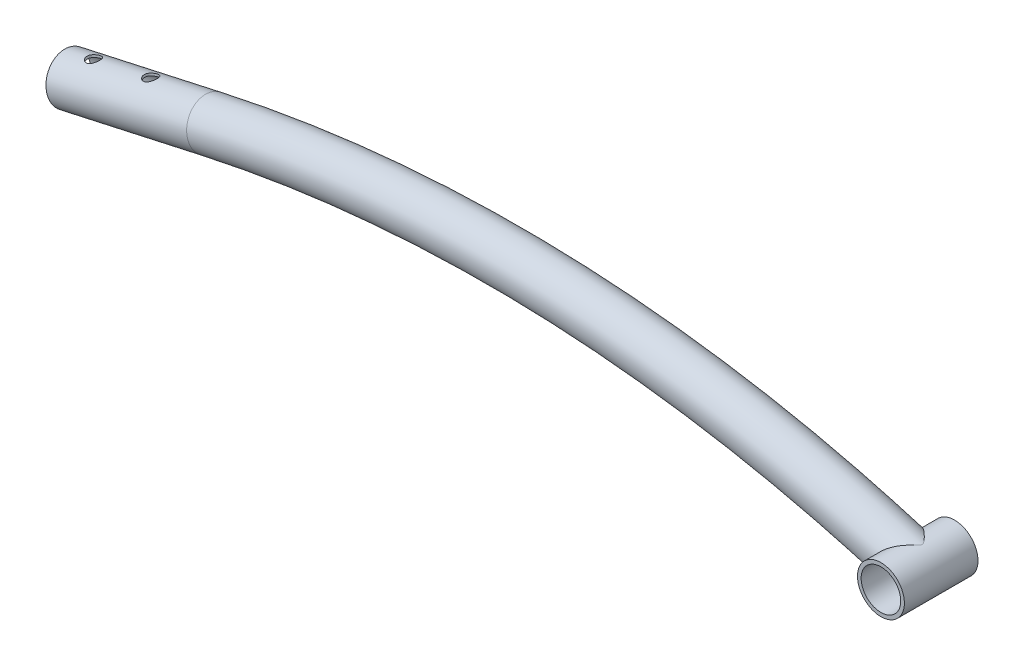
ISO-10303-21;
HEADER;
FILE_DESCRIPTION(('STEP AP214'),'2;1');
FILE_NAME('part.step','',(''),(''),'','','');
FILE_SCHEMA(('AUTOMOTIVE_DESIGN { 1 0 10303 214 1 1 1 1 }'));
ENDSEC;
DATA;
#1=APPLICATION_CONTEXT('core data for automotive mechanical design processes');
#2=APPLICATION_PROTOCOL_DEFINITION('international standard','automotive_design',2000,#1);
#3=PRODUCT_CONTEXT('',#1,'mechanical');
#4=PRODUCT('Part','Part','',(#3));
#5=PRODUCT_RELATED_PRODUCT_CATEGORY('part','',(#4));
#6=PRODUCT_DEFINITION_FORMATION('','',#4);
#7=PRODUCT_DEFINITION_CONTEXT('part definition',#1,'design');
#8=PRODUCT_DEFINITION('design','',#6,#7);
#9=PRODUCT_DEFINITION_SHAPE('','',#8);
#10=(LENGTH_UNIT() NAMED_UNIT(*) SI_UNIT(.MILLI.,.METRE.));
#11=(NAMED_UNIT(*) PLANE_ANGLE_UNIT() SI_UNIT($,.RADIAN.));
#12=(NAMED_UNIT(*) SI_UNIT($,.STERADIAN.) SOLID_ANGLE_UNIT());
#13=UNCERTAINTY_MEASURE_WITH_UNIT(LENGTH_MEASURE(1.E-05),#10,'distance_accuracy_value','');
#14=(GEOMETRIC_REPRESENTATION_CONTEXT(3) GLOBAL_UNCERTAINTY_ASSIGNED_CONTEXT((#13)) GLOBAL_UNIT_ASSIGNED_CONTEXT((#10,
#11,#12)) REPRESENTATION_CONTEXT('',''));
#15=CARTESIAN_POINT('',(0.,0.,0.));
#16=DIRECTION('',(0.,0.,1.));
#17=DIRECTION('',(1.,0.,0.));
#18=AXIS2_PLACEMENT_3D('',#15,#16,#17);
#19=CARTESIAN_POINT('',(419.518991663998,-663.791446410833,0.));
#20=DIRECTION('',(0.,0.,-1.));
#21=DIRECTION('',(-1.,0.,0.));
#22=AXIS2_PLACEMENT_3D('',#19,#20,#21);
#23=TOROIDAL_SURFACE('',#22,930.,15.9);
#24=CARTESIAN_POINT('',(218.540371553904,244.232558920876,0.));
#25=DIRECTION('',(-0.976369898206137,-0.216106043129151,0.));
#26=DIRECTION('',(0.216106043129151,-0.976369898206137,0.));
#27=AXIS2_PLACEMENT_3D('',#24,#25,#26);
#28=CIRCLE('',#27,15.9);
#29=CARTESIAN_POINT('',(221.976457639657,228.708277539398,0.));
#30=VERTEX_POINT('',#29);
#31=EDGE_CURVE('E26',#30,#30,#28,.T.);
#32=ORIENTED_EDGE('',*,*,#31,.F.);
#33=EDGE_LOOP('',(#32));
#34=FACE_BOUND('',#33,.T.);
#35=CARTESIAN_POINT('',(688.555758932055,212.416610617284,-8.52932562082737));
#36=CARTESIAN_POINT('',(688.227871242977,212.812124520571,-8.97274578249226));
#37=CARTESIAN_POINT('',(687.914068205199,213.229399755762,-9.40737734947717));
#38=CARTESIAN_POINT('',(687.320144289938,214.108144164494,-10.2550141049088));
#39=CARTESIAN_POINT('',(687.04003786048,214.569632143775,-10.6680099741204));
#40=CARTESIAN_POINT('',(686.520568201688,215.536174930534,-11.465938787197));
#41=CARTESIAN_POINT('',(686.281117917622,216.041133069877,-11.8509306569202));
#42=CARTESIAN_POINT('',(685.957896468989,216.830884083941,-12.4023359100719));
#43=CARTESIAN_POINT('',(685.856174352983,217.099431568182,-12.5817388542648));
#44=CARTESIAN_POINT('',(685.665683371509,217.647272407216,-12.930943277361));
#45=CARTESIAN_POINT('',(685.576916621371,217.926567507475,-13.1007431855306));
#46=CARTESIAN_POINT('',(685.402461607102,218.533936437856,-13.4517404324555));
#47=CARTESIAN_POINT('',(685.318808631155,218.863503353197,-13.6313793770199));
#48=CARTESIAN_POINT('',(685.171475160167,219.53504222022,-13.9747728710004));
#49=CARTESIAN_POINT('',(685.107787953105,219.877009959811,-14.1385327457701));
#50=CARTESIAN_POINT('',(685.002177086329,220.572086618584,-14.448107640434));
#51=CARTESIAN_POINT('',(684.960242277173,220.925189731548,-14.5939318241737));
#52=CARTESIAN_POINT('',(684.89985215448,221.641040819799,-14.8655812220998));
#53=CARTESIAN_POINT('',(684.881397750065,222.003789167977,-14.9914056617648));
#54=CARTESIAN_POINT('',(684.869525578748,222.740363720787,-15.2220302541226));
#55=CARTESIAN_POINT('',(684.876360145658,223.114264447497,-15.3266074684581));
#56=CARTESIAN_POINT('',(684.916977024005,223.866728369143,-15.5110388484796));
#57=CARTESIAN_POINT('',(684.950759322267,224.2452915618,-15.5908930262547));
#58=CARTESIAN_POINT('',(685.046082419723,225.003308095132,-15.7240353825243));
#59=CARTESIAN_POINT('',(685.107600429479,225.382760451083,-15.777345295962));
#60=CARTESIAN_POINT('',(685.258589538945,226.138967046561,-15.8562067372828));
#61=CARTESIAN_POINT('',(685.348056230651,226.515721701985,-15.8817626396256));
#62=CARTESIAN_POINT('',(685.540192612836,227.211166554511,-15.902959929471));
#63=CARTESIAN_POINT('',(685.639360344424,227.530723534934,-15.9022284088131));
#64=CARTESIAN_POINT('',(685.857268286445,228.162307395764,-15.879731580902));
#65=CARTESIAN_POINT('',(685.976006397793,228.474335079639,-15.8579685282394));
#66=CARTESIAN_POINT('',(686.231898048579,229.088542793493,-15.7938646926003));
#67=CARTESIAN_POINT('',(686.369051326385,229.390722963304,-15.7515242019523));
#68=CARTESIAN_POINT('',(686.660336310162,229.983240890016,-15.6470803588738));
#69=CARTESIAN_POINT('',(686.814468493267,230.273578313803,-15.5849764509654));
#70=CARTESIAN_POINT('',(687.132493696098,230.830981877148,-15.444572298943));
#71=CARTESIAN_POINT('',(687.295867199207,231.098505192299,-15.3669040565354));
#72=CARTESIAN_POINT('',(687.635364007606,231.619853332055,-15.1953400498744));
#73=CARTESIAN_POINT('',(687.811486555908,231.873678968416,-15.1014452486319));
#74=CARTESIAN_POINT('',(688.174979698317,232.366915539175,-14.8986615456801));
#75=CARTESIAN_POINT('',(688.362352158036,232.606324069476,-14.7897701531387));
#76=CARTESIAN_POINT('',(688.746854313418,233.070241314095,-14.5582777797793));
#77=CARTESIAN_POINT('',(688.943986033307,233.294746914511,-14.4356739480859));
#78=CARTESIAN_POINT('',(689.436081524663,233.825023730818,-14.1207579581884));
#79=CARTESIAN_POINT('',(689.735600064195,234.122586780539,-13.921675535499));
#80=CARTESIAN_POINT('',(690.348307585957,234.686152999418,-13.5011174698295));
#81=CARTESIAN_POINT('',(690.661501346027,234.95214501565,-13.2796339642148));
#82=CARTESIAN_POINT('',(691.298884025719,235.453631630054,-12.817079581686));
#83=CARTESIAN_POINT('',(691.623092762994,235.689067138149,-12.5759721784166));
#84=CARTESIAN_POINT('',(692.279166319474,236.129815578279,-12.0773779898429));
#85=CARTESIAN_POINT('',(692.611031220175,236.335128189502,-11.8198910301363));
#86=CARTESIAN_POINT('',(693.40577557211,236.788477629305,-11.191614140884));
#87=CARTESIAN_POINT('',(693.871083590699,237.02363245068,-10.8145673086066));
#88=CARTESIAN_POINT('',(694.80709033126,237.442419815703,-10.039061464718));
#89=CARTESIAN_POINT('',(695.277791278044,237.626030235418,-9.64059334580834));
#90=CARTESIAN_POINT('',(696.220696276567,237.944801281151,-8.82608803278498));
#91=CARTESIAN_POINT('',(696.69290095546,238.079937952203,-8.41004226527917));
#92=CARTESIAN_POINT('',(697.634968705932,238.304457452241,-7.56357048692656));
#93=CARTESIAN_POINT('',(698.104832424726,238.393853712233,-7.13314873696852));
#94=CARTESIAN_POINT('',(698.893320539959,238.508471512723,-6.39558858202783));
#95=CARTESIAN_POINT('',(699.213488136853,238.545007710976,-6.09178754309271));
#96=CARTESIAN_POINT('',(699.849683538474,238.59855006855,-5.47816491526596));
#97=CARTESIAN_POINT('',(700.165711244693,238.615555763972,-5.16834318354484));
#98=CARTESIAN_POINT('',(700.791134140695,238.630979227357,-4.54268401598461));
#99=CARTESIAN_POINT('',(701.100540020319,238.62942964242,-4.22685812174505));
#100=CARTESIAN_POINT('',(701.55732930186,238.614247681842,-3.74668850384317));
#101=CARTESIAN_POINT('',(701.708356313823,238.607045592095,-3.58557818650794));
#102=CARTESIAN_POINT('',(702.007159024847,238.5886260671,-3.260601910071));
#103=CARTESIAN_POINT('',(702.154934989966,238.577408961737,-3.09673617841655));
#104=CARTESIAN_POINT('',(702.480210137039,238.548280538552,-2.72632796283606));
#105=CARTESIAN_POINT('',(702.656520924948,238.529415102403,-2.51881666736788));
#106=CARTESIAN_POINT('',(702.997995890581,238.487381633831,-2.09479841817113));
#107=CARTESIAN_POINT('',(703.163156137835,238.464212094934,-1.87828833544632));
#108=CARTESIAN_POINT('',(703.411930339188,238.425779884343,-1.51502485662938));
#109=CARTESIAN_POINT('',(703.502626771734,238.410870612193,-1.37314840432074));
#110=CARTESIAN_POINT('',(703.668930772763,238.382256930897,-1.08042099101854));
#111=CARTESIAN_POINT('',(703.744556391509,238.36855109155,-0.929581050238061));
#112=CARTESIAN_POINT('',(703.847983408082,238.34926848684,-0.668694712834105));
#113=CARTESIAN_POINT('',(703.883322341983,238.342505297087,-0.561833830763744));
#114=CARTESIAN_POINT('',(703.936658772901,238.332196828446,-0.343872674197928));
#115=CARTESIAN_POINT('',(703.954719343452,238.328639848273,-0.23278937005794));
#116=CARTESIAN_POINT('',(703.96979563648,238.325675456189,-0.00805755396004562));
#117=CARTESIAN_POINT('',(703.966625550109,238.326304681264,0.105604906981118));
#118=CARTESIAN_POINT('',(703.939565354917,238.33161039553,0.33039701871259));
#119=CARTESIAN_POINT('',(703.915629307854,238.336295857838,0.441520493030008));
#120=CARTESIAN_POINT('',(703.836031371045,238.35153853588,0.712952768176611));
#121=CARTESIAN_POINT('',(703.770495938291,238.363859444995,0.870115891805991));
#122=CARTESIAN_POINT('',(703.6192479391,238.390959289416,1.17445173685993));
#123=CARTESIAN_POINT('',(703.533422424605,238.405751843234,1.32156236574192));
#124=CARTESIAN_POINT('',(703.341368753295,238.436989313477,1.62254788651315));
#125=CARTESIAN_POINT('',(703.233962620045,238.453453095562,1.77565523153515));
#126=CARTESIAN_POINT('',(703.011019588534,238.485109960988,2.0760268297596));
#127=CARTESIAN_POINT('',(702.895476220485,238.500302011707,2.22328628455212));
#128=CARTESIAN_POINT('',(702.658903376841,238.528655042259,2.51406880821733));
#129=CARTESIAN_POINT('',(702.537862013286,238.541811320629,2.65758261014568));
#130=CARTESIAN_POINT('',(702.292117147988,238.565601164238,2.94166304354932));
#131=CARTESIAN_POINT('',(702.16741320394,238.576234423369,3.08222931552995));
#132=CARTESIAN_POINT('',(701.788427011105,238.603967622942,3.50160684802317));
#133=CARTESIAN_POINT('',(701.530124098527,238.616795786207,3.77707926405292));
#134=CARTESIAN_POINT('',(701.007382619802,238.62972184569,4.32171508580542));
#135=CARTESIAN_POINT('',(700.742952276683,238.629835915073,4.59088607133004));
#136=CARTESIAN_POINT('',(700.208368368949,238.616562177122,5.12566815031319));
#137=CARTESIAN_POINT('',(699.938193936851,238.603111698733,5.39125692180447));
#138=CARTESIAN_POINT('',(699.394619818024,238.561991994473,5.91800848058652));
#139=CARTESIAN_POINT('',(699.121219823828,238.534321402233,6.17917084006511));
#140=CARTESIAN_POINT('',(698.297115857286,238.429077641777,6.95655184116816));
#141=CARTESIAN_POINT('',(697.742891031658,238.3292802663,7.46628446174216));
#142=CARTESIAN_POINT('',(696.632933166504,238.066505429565,8.46422492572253));
#143=CARTESIAN_POINT('',(696.07720871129,237.903705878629,8.95248910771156));
#144=CARTESIAN_POINT('',(694.968615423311,237.510309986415,9.90396014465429));
#145=CARTESIAN_POINT('',(694.415744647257,237.279768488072,10.367186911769));
#146=CARTESIAN_POINT('',(693.526354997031,236.846614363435,11.0930589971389));
#147=CARTESIAN_POINT('',(693.186868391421,236.666252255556,11.3654722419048));
#148=CARTESIAN_POINT('',(692.513553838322,236.276005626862,11.895882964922));
#149=CARTESIAN_POINT('',(692.179725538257,236.066122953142,12.1538813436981));
#150=CARTESIAN_POINT('',(691.520457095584,235.615884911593,12.6527046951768));
#151=CARTESIAN_POINT('',(691.195009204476,235.375559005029,12.8935459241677));
#152=CARTESIAN_POINT('',(690.55508307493,234.863335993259,13.3553567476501));
#153=CARTESIAN_POINT('',(690.240601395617,234.591448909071,13.5763326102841));
#154=CARTESIAN_POINT('',(689.685952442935,234.071728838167,13.9542226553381));
#155=CARTESIAN_POINT('',(689.443259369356,233.829556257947,14.115222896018));
#156=CARTESIAN_POINT('',(688.969272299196,233.324465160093,14.4202183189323));
#157=CARTESIAN_POINT('',(688.737972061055,233.061558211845,14.5642228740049));
#158=CARTESIAN_POINT('',(688.288895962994,232.515253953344,14.8332774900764));
#159=CARTESIAN_POINT('',(688.071119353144,232.231857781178,14.9583286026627));
#160=CARTESIAN_POINT('',(687.651489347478,231.645389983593,15.1874177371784));
#161=CARTESIAN_POINT('',(687.449636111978,231.342318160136,15.2914555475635));
#162=CARTESIAN_POINT('',(687.062610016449,230.715091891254,15.477365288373));
#163=CARTESIAN_POINT('',(686.877604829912,230.390771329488,15.5590278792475));
#164=CARTESIAN_POINT('',(686.528869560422,229.725681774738,15.6971265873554));
#165=CARTESIAN_POINT('',(686.365139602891,229.384912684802,15.7535625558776));
#166=CARTESIAN_POINT('',(686.061341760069,228.6900113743,15.8397945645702));
#167=CARTESIAN_POINT('',(685.921256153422,228.335889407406,15.8696106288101));
#168=CARTESIAN_POINT('',(685.666438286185,227.617446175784,15.9018706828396));
#169=CARTESIAN_POINT('',(685.551702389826,227.253126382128,15.9043186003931));
#170=CARTESIAN_POINT('',(685.363313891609,226.570687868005,15.8833689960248));
#171=CARTESIAN_POINT('',(685.286131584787,226.253419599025,15.8636204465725));
#172=CARTESIAN_POINT('',(685.151607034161,225.616573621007,15.8043108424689));
#173=CARTESIAN_POINT('',(685.094262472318,225.296996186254,15.7647521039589));
#174=CARTESIAN_POINT('',(684.999387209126,224.657853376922,15.6665005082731));
#175=CARTESIAN_POINT('',(684.961857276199,224.338288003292,15.6078069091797));
#176=CARTESIAN_POINT('',(684.906243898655,223.701335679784,15.4722472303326));
#177=CARTESIAN_POINT('',(684.888161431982,223.383948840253,15.3953802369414));
#178=CARTESIAN_POINT('',(684.870768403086,222.752427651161,15.2244086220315));
#179=CARTESIAN_POINT('',(684.871509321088,222.43830457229,15.1302574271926));
#180=CARTESIAN_POINT('',(684.89101149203,221.815845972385,14.9261624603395));
#181=CARTESIAN_POINT('',(684.909772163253,221.50751026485,14.8162191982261));
#182=CARTESIAN_POINT('',(684.964299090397,220.897889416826,14.5818638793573));
#183=CARTESIAN_POINT('',(685.000068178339,220.596605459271,14.4574494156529));
#184=CARTESIAN_POINT('',(685.087519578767,220.002140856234,14.1954901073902));
#185=CARTESIAN_POINT('',(685.139205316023,219.70896196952,14.0579424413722));
#186=CARTESIAN_POINT('',(685.287053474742,218.986534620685,13.6989546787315));
#187=CARTESIAN_POINT('',(685.392518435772,218.562856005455,13.4700612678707));
#188=CARTESIAN_POINT('',(685.633157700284,217.737371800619,12.9895419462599));
#189=CARTESIAN_POINT('',(685.768343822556,217.33557499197,12.7379070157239));
#190=CARTESIAN_POINT('',(686.065317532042,216.55397884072,12.2148379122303));
#191=CARTESIAN_POINT('',(686.227166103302,216.174232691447,11.9433591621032));
#192=CARTESIAN_POINT('',(686.574107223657,215.438190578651,11.3841541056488));
#193=CARTESIAN_POINT('',(686.759199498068,215.081894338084,11.0964279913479));
#194=CARTESIAN_POINT('',(687.226389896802,214.25780266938,10.3918336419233));
#195=CARTESIAN_POINT('',(687.518099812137,213.800953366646,9.96849965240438));
#196=CARTESIAN_POINT('',(688.1348605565,212.93209948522,9.10047626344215));
#197=CARTESIAN_POINT('',(688.459927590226,212.520116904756,8.65577654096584));
#198=CARTESIAN_POINT('',(689.137473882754,211.740805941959,7.74940576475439));
#199=CARTESIAN_POINT('',(689.489932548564,211.373444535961,7.28774759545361));
#200=CARTESIAN_POINT('',(690.217087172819,210.682692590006,6.34980593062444));
#201=CARTESIAN_POINT('',(690.591772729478,210.359281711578,5.87352932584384));
#202=CARTESIAN_POINT('',(691.232160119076,209.854970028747,5.06413183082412));
#203=CARTESIAN_POINT('',(691.493523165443,209.662005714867,4.73501758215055));
#204=CARTESIAN_POINT('',(692.020268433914,209.296820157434,4.06912551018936));
#205=CARTESIAN_POINT('',(692.285646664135,209.124579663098,3.73235515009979));
#206=CARTESIAN_POINT('',(692.729960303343,208.853947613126,3.15660557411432));
#207=CARTESIAN_POINT('',(692.909375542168,208.749564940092,2.92082855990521));
#208=CARTESIAN_POINT('',(693.174515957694,208.601837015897,2.56048000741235));
#209=CARTESIAN_POINT('',(693.262255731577,208.554056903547,2.43921601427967));
#210=CARTESIAN_POINT('',(693.435295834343,208.461845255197,2.19372290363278));
#211=CARTESIAN_POINT('',(693.520596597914,208.417413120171,2.06949432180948));
#212=CARTESIAN_POINT('',(693.705852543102,208.322929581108,1.78856431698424));
#213=CARTESIAN_POINT('',(693.804784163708,208.273864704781,1.63084799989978));
#214=CARTESIAN_POINT('',(693.990887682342,208.183719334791,1.30601414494));
#215=CARTESIAN_POINT('',(694.078062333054,208.142636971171,1.1388988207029));
#216=CARTESIAN_POINT('',(694.200681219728,208.085877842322,0.854313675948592));
#217=CARTESIAN_POINT('',(694.243412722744,208.066393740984,0.740867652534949));
#218=CARTESIAN_POINT('',(694.313170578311,208.034833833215,0.508430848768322));
#219=CARTESIAN_POINT('',(694.340257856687,208.022729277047,0.389463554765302));
#220=CARTESIAN_POINT('',(694.373176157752,208.008043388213,0.145847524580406));
#221=CARTESIAN_POINT('',(694.378666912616,208.005614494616,0.0211389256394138));
#222=CARTESIAN_POINT('',(694.365732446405,208.011368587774,-0.226775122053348));
#223=CARTESIAN_POINT('',(694.347282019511,208.019562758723,-0.34997884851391));
#224=CARTESIAN_POINT('',(694.283821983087,208.048064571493,-0.624099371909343));
#225=CARTESIAN_POINT('',(694.232873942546,208.071097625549,-0.773246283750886));
#226=CARTESIAN_POINT('',(694.11290725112,208.126421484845,-1.0626716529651));
#227=CARTESIAN_POINT('',(694.043778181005,208.158768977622,-1.20288918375));
#228=CARTESIAN_POINT('',(693.89457494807,208.230130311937,-1.47814187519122));
#229=CARTESIAN_POINT('',(693.814358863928,208.269232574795,-1.61307472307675));
#230=CARTESIAN_POINT('',(693.648102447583,208.352164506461,-1.87785112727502));
#231=CARTESIAN_POINT('',(693.562057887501,208.395997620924,-2.00769087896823));
#232=CARTESIAN_POINT('',(693.298686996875,208.533372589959,-2.392438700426));
#233=CARTESIAN_POINT('',(693.116500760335,208.632612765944,-2.64194710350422));
#234=CARTESIAN_POINT('',(692.747990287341,208.843259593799,-3.13361965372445));
#235=CARTESIAN_POINT('',(692.561656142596,208.954698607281,-3.37576197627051));
#236=CARTESIAN_POINT('',(692.189120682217,209.18822795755,-3.85433613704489));
#237=CARTESIAN_POINT('',(692.002919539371,209.310303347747,-4.09077541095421));
#238=CARTESIAN_POINT('',(691.52722698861,209.636881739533,-4.69274024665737));
#239=CARTESIAN_POINT('',(691.239115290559,209.848831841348,-5.05533725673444));
#240=CARTESIAN_POINT('',(690.67163841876,210.297093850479,-5.77259033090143));
#241=CARTESIAN_POINT('',(690.392277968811,210.533418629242,-6.12724207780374));
#242=CARTESIAN_POINT('',(689.845187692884,211.030096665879,-6.82834612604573));
#243=CARTESIAN_POINT('',(689.57745317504,211.290440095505,-7.17480170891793));
#244=CARTESIAN_POINT('',(689.055755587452,211.835308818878,-7.85892935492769));
#245=CARTESIAN_POINT('',(688.801792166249,212.119833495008,-8.19660164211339));
#246=CARTESIAN_POINT('',(688.555758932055,212.416610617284,-8.52932562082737));
#247=B_SPLINE_CURVE_WITH_KNOTS('',3,(#35,#36,#37,#38,#39,#40,#41,#42,#43,#44,#45,#46,#47,#48,
#49,#50,#51,#52,#53,#54,#55,#56,#57,#58,#59,#60,#61,#62,#63,#64,#65,#66,#67,#68,#69,#70,#71,#72,
#73,#74,#75,#76,#77,#78,#79,#80,#81,#82,#83,#84,#85,#86,#87,#88,#89,#90,#91,#92,#93,#94,#95,#96,
#97,#98,#99,#100,#101,#102,#103,#104,#105,#106,#107,#108,#109,#110,#111,#112,#113,#114,#115,
#116,#117,#118,#119,#120,#121,#122,#123,#124,#125,#126,#127,#128,#129,#130,#131,#132,#133,#134,
#135,#136,#137,#138,#139,#140,#141,#142,#143,#144,#145,#146,#147,#148,#149,#150,#151,#152,#153,
#154,#155,#156,#157,#158,#159,#160,#161,#162,#163,#164,#165,#166,#167,#168,#169,#170,#171,#172,
#173,#174,#175,#176,#177,#178,#179,#180,#181,#182,#183,#184,#185,#186,#187,#188,#189,#190,#191,
#192,#193,#194,#195,#196,#197,#198,#199,#200,#201,#202,#203,#204,#205,#206,#207,#208,#209,#210,
#211,#212,#213,#214,#215,#216,#217,#218,#219,#220,#221,#222,#223,#224,#225,#226,#227,#228,#229,
#230,#231,#232,#233,#234,#235,#236,#237,#238,#239,#240,#241,#242,#243,#244,#245,#246),
.UNSPECIFIED.,.T.,.F.,(4,2,2,2,2,2,2,2,2,2,2,2,2,2,2,2,2,2,2,2,2,2,2,2,2,2,2,2,2,2,2,2,2,2,2,2,
2,2,2,2,2,2,2,2,2,2,2,2,2,2,2,2,2,2,2,2,2,2,2,2,2,2,2,2,2,2,2,2,2,2,2,2,2,2,2,2,2,2,2,2,2,2,2,2,
2,2,2,2,2,2,2,2,2,2,2,2,2,2,2,2,2,2,2,2,2,4),(0.,2.03549819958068,4.07186606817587,
6.10381702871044,7.11916150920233,8.13467158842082,9.28734754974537,10.4396355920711,
11.5913324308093,12.7430738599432,13.9063382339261,15.0696020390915,16.2319117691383,
17.3940382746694,18.3965240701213,19.3989024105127,20.4012665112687,21.4036587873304,
22.3715023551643,23.3392885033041,24.3072355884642,25.2753842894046,26.6736529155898,
28.0724140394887,29.4738410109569,30.8752829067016,32.802662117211,34.7308673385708,
36.6600241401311,38.5886141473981,39.9167768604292,41.2449711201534,42.5708288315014,
43.23361235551,43.8963414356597,44.7150188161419,45.5339832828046,46.0407037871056,
46.5468136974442,46.884022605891,47.2199958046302,47.5589132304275,47.8985823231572,
48.4078524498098,48.9200271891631,49.482801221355,50.0460278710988,50.6105364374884,
51.1751134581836,52.3082603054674,53.4399656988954,54.5769238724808,55.7139913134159,
57.9897403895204,60.2591093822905,62.5266461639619,63.9391184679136,65.3515024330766,
66.7625298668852,68.1731105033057,69.3084138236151,70.4430880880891,71.5776993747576,
72.7123220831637,73.857223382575,75.0021314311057,76.1461775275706,77.2900594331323,
78.270223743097,79.2502734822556,80.2303612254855,81.2104982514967,82.1933161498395,
83.1761023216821,84.159052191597,85.1422137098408,86.6188882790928,88.0961511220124,
89.5768410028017,91.0575133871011,93.1177605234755,95.1790132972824,97.238731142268,
99.2974925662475,100.68437729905,102.069963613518,103.012043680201,103.483340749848,
103.954553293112,104.531837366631,105.108986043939,105.476432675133,105.842438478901,
106.214188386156,106.586329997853,107.061491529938,107.539608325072,108.024537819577,
108.509822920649,109.482647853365,110.458119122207,111.432241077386,112.959444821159,
114.48745919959,116.014851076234,117.542203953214),.UNSPECIFIED.);
#248=CARTESIAN_POINT('',(688.555758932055,212.416610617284,-8.52932562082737));
#249=VERTEX_POINT('',#248);
#250=EDGE_CURVE('E10',#249,#249,#247,.T.);
#251=ORIENTED_EDGE('',*,*,#250,.F.);
#252=EDGE_LOOP('',(#251));
#253=FACE_BOUND('',#252,.T.);
#254=ADVANCED_FACE('F14',(#34,#253),#23,.T.);
#255=CARTESIAN_POINT('',(419.518991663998,-663.791446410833,0.));
#256=DIRECTION('',(0.,0.,-1.));
#257=DIRECTION('',(-1.,0.,0.));
#258=AXIS2_PLACEMENT_3D('',#255,#256,#257);
#259=TOROIDAL_SURFACE('',#258,930.,14.4);
#260=CARTESIAN_POINT('',(218.540371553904,244.232558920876,0.));
#261=DIRECTION('',(-0.976369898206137,-0.216106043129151,0.));
#262=DIRECTION('',(0.216106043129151,-0.976369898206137,0.));
#263=AXIS2_PLACEMENT_3D('',#260,#261,#262);
#264=CIRCLE('',#263,14.4);
#265=CARTESIAN_POINT('',(221.652298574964,230.172832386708,0.));
#266=VERTEX_POINT('',#265);
#267=EDGE_CURVE('E31',#266,#266,#264,.T.);
#268=ORIENTED_EDGE('',*,*,#267,.T.);
#269=EDGE_LOOP('',(#268));
#270=FACE_BOUND('',#269,.T.);
#271=CARTESIAN_POINT('',(687.661116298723,213.603996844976,-7.06917317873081));
#272=CARTESIAN_POINT('',(687.545103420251,213.77385252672,-7.29727571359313));
#273=CARTESIAN_POINT('',(687.429853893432,213.949631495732,-7.52136849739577));
#274=CARTESIAN_POINT('',(687.202369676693,214.312586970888,-7.96176773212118));
#275=CARTESIAN_POINT('',(687.090135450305,214.499765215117,-8.17807298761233));
#276=CARTESIAN_POINT('',(686.869897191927,214.885348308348,-8.60309175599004));
#277=CARTESIAN_POINT('',(686.761896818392,215.083762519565,-8.81179869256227));
#278=CARTESIAN_POINT('',(686.551410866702,215.491411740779,-9.22128217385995));
#279=CARTESIAN_POINT('',(686.448926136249,215.700648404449,-9.42205749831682));
#280=CARTESIAN_POINT('',(686.151224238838,216.3447652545,-10.0125070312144));
#281=CARTESIAN_POINT('',(685.965914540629,216.795785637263,-10.3900107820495));
#282=CARTESIAN_POINT('',(685.714606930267,217.502409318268,-10.9281895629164));
#283=CARTESIAN_POINT('',(685.635303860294,217.742875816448,-11.1028462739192));
#284=CARTESIAN_POINT('',(685.486561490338,218.233765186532,-11.4422659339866));
#285=CARTESIAN_POINT('',(685.417123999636,218.484189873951,-11.6070270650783));
#286=CARTESIAN_POINT('',(685.276916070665,219.043765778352,-11.9565062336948));
#287=CARTESIAN_POINT('',(685.208469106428,219.354931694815,-12.1389486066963));
#288=CARTESIAN_POINT('',(685.089134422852,219.989802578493,-12.486802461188));
#289=CARTESIAN_POINT('',(685.038241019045,220.313503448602,-12.6522194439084));
#290=CARTESIAN_POINT('',(684.955918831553,220.97185861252,-12.9640442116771));
#291=CARTESIAN_POINT('',(684.924464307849,221.30649780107,-13.110476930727));
#292=CARTESIAN_POINT('',(684.882708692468,221.985451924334,-13.3826190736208));
#293=CARTESIAN_POINT('',(684.872408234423,222.329767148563,-13.5083278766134));
#294=CARTESIAN_POINT('',(684.87458226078,223.029461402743,-13.7381911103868));
#295=CARTESIAN_POINT('',(684.887293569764,223.384918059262,-13.8421089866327));
#296=CARTESIAN_POINT('',(684.937273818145,224.100598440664,-14.0247670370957));
#297=CARTESIAN_POINT('',(684.974542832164,224.460822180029,-14.103507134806));
#298=CARTESIAN_POINT('',(685.074416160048,225.182410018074,-14.2340945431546));
#299=CARTESIAN_POINT('',(685.137003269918,225.54377317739,-14.2859600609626));
#300=CARTESIAN_POINT('',(685.287676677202,226.264096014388,-14.3616847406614));
#301=CARTESIAN_POINT('',(685.375758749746,226.623056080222,-14.3855485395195));
#302=CARTESIAN_POINT('',(685.562314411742,227.283296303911,-14.4033647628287));
#303=CARTESIAN_POINT('',(685.657454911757,227.585425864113,-14.4011361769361));
#304=CARTESIAN_POINT('',(685.865189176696,228.182706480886,-14.375878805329));
#305=CARTESIAN_POINT('',(685.977780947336,228.477858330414,-14.3528523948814));
#306=CARTESIAN_POINT('',(686.219303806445,229.059017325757,-14.286448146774));
#307=CARTESIAN_POINT('',(686.348234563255,229.345024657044,-14.2430707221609));
#308=CARTESIAN_POINT('',(686.62106123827,229.906040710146,-14.1367394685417));
#309=CARTESIAN_POINT('',(686.76495762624,230.181049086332,-14.0737850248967));
#310=CARTESIAN_POINT('',(687.061467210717,230.710178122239,-13.9315791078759));
#311=CARTESIAN_POINT('',(687.213670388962,230.96468234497,-13.8528950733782));
#312=CARTESIAN_POINT('',(687.529156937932,231.460883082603,-13.6792113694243));
#313=CARTESIAN_POINT('',(687.692439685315,231.702580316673,-13.5842126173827));
#314=CARTESIAN_POINT('',(688.028600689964,232.172475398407,-13.3790520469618));
#315=CARTESIAN_POINT('',(688.201479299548,232.400672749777,-13.2688896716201));
#316=CARTESIAN_POINT('',(688.555387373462,232.843160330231,-13.0345645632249));
#317=CARTESIAN_POINT('',(688.736418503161,233.0574476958,-12.9103989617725));
#318=CARTESIAN_POINT('',(689.185596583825,233.562196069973,-12.5922898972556));
#319=CARTESIAN_POINT('',(689.457343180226,233.845181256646,-12.391510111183));
#320=CARTESIAN_POINT('',(690.010987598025,234.38214652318,-11.9664930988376));
#321=CARTESIAN_POINT('',(690.292889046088,234.636116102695,-11.7422474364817));
#322=CARTESIAN_POINT('',(690.864142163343,235.116301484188,-11.2723284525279));
#323=CARTESIAN_POINT('',(691.153511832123,235.342440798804,-11.02659911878));
#324=CARTESIAN_POINT('',(691.735773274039,235.76714796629,-10.5163934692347));
#325=CARTESIAN_POINT('',(692.028664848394,235.965717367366,-10.2519182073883));
#326=CARTESIAN_POINT('',(692.689339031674,236.383501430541,-9.6365581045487));
#327=CARTESIAN_POINT('',(693.057301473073,236.595207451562,-9.2807533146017));
#328=CARTESIAN_POINT('',(693.788308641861,236.9798687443,-8.54376880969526));
#329=CARTESIAN_POINT('',(694.15135055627,237.152802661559,-8.16257526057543));
#330=CARTESIAN_POINT('',(694.864934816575,237.462186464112,-7.37570961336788));
#331=CARTESIAN_POINT('',(695.215497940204,237.59869971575,-6.970081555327));
#332=CARTESIAN_POINT('',(695.725165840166,237.778329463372,-6.34175235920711));
#333=CARTESIAN_POINT('',(695.892315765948,237.834004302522,-6.12905529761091));
#334=CARTESIAN_POINT('',(696.219658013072,237.937355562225,-5.69650515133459));
#335=CARTESIAN_POINT('',(696.379851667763,237.985033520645,-5.47665345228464));
#336=CARTESIAN_POINT('',(696.672145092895,238.067363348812,-5.05670530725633));
#337=CARTESIAN_POINT('',(696.80527795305,238.102895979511,-4.85750172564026));
#338=CARTESIAN_POINT('',(697.062908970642,238.168340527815,-4.45268067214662));
#339=CARTESIAN_POINT('',(697.18740761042,238.198252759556,-4.24706355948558));
#340=CARTESIAN_POINT('',(697.425502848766,238.252701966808,-3.82904974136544));
#341=CARTESIAN_POINT('',(697.539107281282,238.277242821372,-3.61665805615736));
#342=CARTESIAN_POINT('',(697.752729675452,238.321238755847,-3.18471747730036));
#343=CARTESIAN_POINT('',(697.85274955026,238.340694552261,-2.96516959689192));
#344=CARTESIAN_POINT('',(698.095424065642,238.38588582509,-2.37340433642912));
#345=CARTESIAN_POINT('',(698.223643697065,238.407507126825,-1.99454258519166));
#346=CARTESIAN_POINT('',(698.368550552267,238.430930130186,-1.41466309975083));
#347=CARTESIAN_POINT('',(698.40893370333,238.437234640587,-1.21962295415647));
#348=CARTESIAN_POINT('',(698.472210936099,238.446970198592,-0.826597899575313));
#349=CARTESIAN_POINT('',(698.495106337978,238.450401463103,-0.628613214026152));
#350=CARTESIAN_POINT('',(698.522293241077,238.454464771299,-0.229812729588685));
#351=CARTESIAN_POINT('',(698.526441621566,238.455075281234,-0.0289868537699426));
#352=CARTESIAN_POINT('',(698.515516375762,238.453451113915,0.372123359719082));
#353=CARTESIAN_POINT('',(698.500442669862,238.451216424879,0.57240769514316));
#354=CARTESIAN_POINT('',(698.451860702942,238.443853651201,0.97097908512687));
#355=CARTESIAN_POINT('',(698.418322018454,238.438720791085,1.16926229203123));
#356=CARTESIAN_POINT('',(698.334448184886,238.425467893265,1.56216745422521));
#357=CARTESIAN_POINT('',(698.28410620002,238.417346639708,1.75678788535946));
#358=CARTESIAN_POINT('',(698.148513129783,238.394600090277,2.20882402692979));
#359=CARTESIAN_POINT('',(698.057210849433,238.378693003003,2.46435637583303));
#360=CARTESIAN_POINT('',(697.853151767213,238.340838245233,2.96620510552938));
#361=CARTESIAN_POINT('',(697.740384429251,238.318887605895,3.21251688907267));
#362=CARTESIAN_POINT('',(697.497747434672,238.26848532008,3.69673522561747));
#363=CARTESIAN_POINT('',(697.367826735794,238.240014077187,3.93461389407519));
#364=CARTESIAN_POINT('',(697.094892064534,238.176212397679,4.40183775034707));
#365=CARTESIAN_POINT('',(696.951873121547,238.140879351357,4.63117965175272));
#366=CARTESIAN_POINT('',(696.664920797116,238.065411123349,5.06792149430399));
#367=CARTESIAN_POINT('',(696.521596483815,238.025710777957,5.2757993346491));
#368=CARTESIAN_POINT('',(696.227892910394,237.939662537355,5.68511360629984));
#369=CARTESIAN_POINT('',(696.077512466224,237.893313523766,5.88654894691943));
#370=CARTESIAN_POINT('',(695.617922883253,237.74381155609,6.48206325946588));
#371=CARTESIAN_POINT('',(695.300384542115,237.630233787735,6.8671742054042));
#372=CARTESIAN_POINT('',(694.651557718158,237.372998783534,7.61596338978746));
#373=CARTESIAN_POINT('',(694.32025057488,237.229299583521,7.97961081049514));
#374=CARTESIAN_POINT('',(693.65047856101,236.909840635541,8.68544112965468));
#375=CARTESIAN_POINT('',(693.312015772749,236.734090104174,9.02763016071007));
#376=CARTESIAN_POINT('',(692.615283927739,236.33843422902,9.70711494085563));
#377=CARTESIAN_POINT('',(692.256897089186,236.116713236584,10.0432390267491));
#378=CARTESIAN_POINT('',(691.542982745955,235.633104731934,10.6890010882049));
#379=CARTESIAN_POINT('',(691.187456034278,235.371206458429,10.9986319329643));
#380=CARTESIAN_POINT('',(690.486095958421,234.806230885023,11.5868664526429));
#381=CARTESIAN_POINT('',(690.140234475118,234.503292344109,11.8655691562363));
#382=CARTESIAN_POINT('',(689.463231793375,233.854329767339,12.3883827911));
#383=CARTESIAN_POINT('',(689.132079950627,233.50833759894,12.6325190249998));
#384=CARTESIAN_POINT('',(688.611084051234,232.910588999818,12.9969291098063));
#385=CARTESIAN_POINT('',(688.41466131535,232.671907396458,13.1294061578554));
#386=CARTESIAN_POINT('',(688.032127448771,232.177954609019,13.3771162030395));
#387=CARTESIAN_POINT('',(687.846013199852,231.922688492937,13.4923544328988));
#388=CARTESIAN_POINT('',(687.486090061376,231.396336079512,13.7040176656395));
#389=CARTESIAN_POINT('',(687.312275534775,231.125257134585,13.8004513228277));
#390=CARTESIAN_POINT('',(686.978824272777,230.568279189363,13.9730824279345));
#391=CARTESIAN_POINT('',(686.8191880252,230.282379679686,14.049279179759));
#392=CARTESIAN_POINT('',(686.515022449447,229.695434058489,14.1805232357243));
#393=CARTESIAN_POINT('',(686.370599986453,229.394300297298,14.2354273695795));
#394=CARTESIAN_POINT('',(686.099866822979,228.780765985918,14.3222813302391));
#395=CARTESIAN_POINT('',(685.973556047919,228.468365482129,14.3542312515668));
#396=CARTESIAN_POINT('',(685.740562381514,227.834936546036,14.3944827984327));
#397=CARTESIAN_POINT('',(685.633873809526,227.513910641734,14.4027912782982));
#398=CARTESIAN_POINT('',(685.441147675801,226.865998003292,14.3955631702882));
#399=CARTESIAN_POINT('',(685.355108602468,226.539111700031,14.3800283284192));
#400=CARTESIAN_POINT('',(685.211623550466,225.91459749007,14.3280857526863));
#401=CARTESIAN_POINT('',(685.152203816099,225.617235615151,14.2938685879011));
#402=CARTESIAN_POINT('',(685.050675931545,225.022314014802,14.2068145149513));
#403=CARTESIAN_POINT('',(685.008566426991,224.724754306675,14.1539790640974));
#404=CARTESIAN_POINT('',(684.94138945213,224.131409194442,14.0304771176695));
#405=CARTESIAN_POINT('',(684.916323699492,223.835623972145,13.9598088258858));
#406=CARTESIAN_POINT('',(684.882698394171,223.247650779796,13.8016290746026));
#407=CARTESIAN_POINT('',(684.874139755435,222.955463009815,13.7141166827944));
#408=CARTESIAN_POINT('',(684.872747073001,222.364723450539,13.5195566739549));
#409=CARTESIAN_POINT('',(684.880552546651,222.066381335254,13.4118700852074));
#410=CARTESIAN_POINT('',(684.912169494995,221.476635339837,13.1807412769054));
#411=CARTESIAN_POINT('',(684.935987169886,221.185234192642,13.0572929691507));
#412=CARTESIAN_POINT('',(684.998487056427,220.610658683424,12.7959677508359));
#413=CARTESIAN_POINT('',(685.037168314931,220.327483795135,12.658091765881));
#414=CARTESIAN_POINT('',(685.128193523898,219.770201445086,12.3691123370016));
#415=CARTESIAN_POINT('',(685.180540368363,219.496095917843,12.2180060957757));
#416=CARTESIAN_POINT('',(685.327869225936,218.81890158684,11.8226944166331));
#417=CARTESIAN_POINT('',(685.43092249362,218.422115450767,11.5706320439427));
#418=CARTESIAN_POINT('',(685.661403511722,217.652577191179,11.0420537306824));
#419=CARTESIAN_POINT('',(685.788842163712,217.279835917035,10.7655268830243));
#420=CARTESIAN_POINT('',(686.064364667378,216.5584138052,10.1897737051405));
#421=CARTESIAN_POINT('',(686.212512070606,216.209812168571,9.89047884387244));
#422=CARTESIAN_POINT('',(686.524939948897,215.538837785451,9.27183042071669));
#423=CARTESIAN_POINT('',(686.689217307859,215.216459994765,8.95248073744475));
#424=CARTESIAN_POINT('',(687.033638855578,214.591292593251,8.28670976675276));
#425=CARTESIAN_POINT('',(687.214068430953,214.289155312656,7.9398238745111));
#426=CARTESIAN_POINT('',(687.582030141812,213.714354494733,7.22567217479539));
#427=CARTESIAN_POINT('',(687.769565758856,213.441705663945,6.8583963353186));
#428=CARTESIAN_POINT('',(688.144431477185,212.929005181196,6.10329510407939));
#429=CARTESIAN_POINT('',(688.331760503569,212.688858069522,5.71553475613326));
#430=CARTESIAN_POINT('',(688.605686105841,212.355671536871,5.11598522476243));
#431=CARTESIAN_POINT('',(688.695784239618,212.249149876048,4.91322980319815));
#432=CARTESIAN_POINT('',(688.872004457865,212.045882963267,4.5012131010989));
#433=CARTESIAN_POINT('',(688.95812748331,211.949135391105,4.29195338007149));
#434=CARTESIAN_POINT('',(689.115001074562,211.776794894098,3.89054488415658));
#435=CARTESIAN_POINT('',(689.18638791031,211.700047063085,3.69914278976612));
#436=CARTESIAN_POINT('',(689.322773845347,211.555990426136,3.31056280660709));
#437=CARTESIAN_POINT('',(689.387773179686,211.488681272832,3.11338513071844));
#438=CARTESIAN_POINT('',(689.509264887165,211.364766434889,2.71351462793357));
#439=CARTESIAN_POINT('',(689.56577256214,211.308141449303,2.51083251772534));
#440=CARTESIAN_POINT('',(689.668146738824,211.206794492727,2.09989775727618));
#441=CARTESIAN_POINT('',(689.714017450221,211.162067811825,1.89164734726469));
#442=CARTESIAN_POINT('',(689.78699033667,211.09153127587,1.5014777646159));
#443=CARTESIAN_POINT('',(689.815865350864,211.063901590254,1.32022205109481));
#444=CARTESIAN_POINT('',(689.86293829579,211.019073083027,0.955115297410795));
#445=CARTESIAN_POINT('',(689.881141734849,211.00186887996,0.771265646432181));
#446=CARTESIAN_POINT('',(689.905966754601,210.978447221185,0.40223893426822));
#447=CARTESIAN_POINT('',(689.912598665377,210.972219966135,0.217063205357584));
#448=CARTESIAN_POINT('',(689.913957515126,210.970942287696,-0.15337381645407));
#449=CARTESIAN_POINT('',(689.908684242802,210.975892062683,-0.338635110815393));
#450=CARTESIAN_POINT('',(689.886543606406,210.996766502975,-0.707320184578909));
#451=CARTESIAN_POINT('',(689.869708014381,211.012661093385,-0.890747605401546));
#452=CARTESIAN_POINT('',(689.82532904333,211.054865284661,-1.25512015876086));
#453=CARTESIAN_POINT('',(689.797781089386,211.081179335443,-1.43606419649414));
#454=CARTESIAN_POINT('',(689.700752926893,211.174769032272,-1.97443241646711));
#455=CARTESIAN_POINT('',(689.616929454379,211.256655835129,-2.32681669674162));
#456=CARTESIAN_POINT('',(689.433321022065,211.441578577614,-2.97645001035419));
#457=CARTESIAN_POINT('',(689.336302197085,211.541301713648,-3.27550260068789));
#458=CARTESIAN_POINT('',(689.128141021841,211.762065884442,-3.86076601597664));
#459=CARTESIAN_POINT('',(689.016985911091,211.883126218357,-4.1469649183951));
#460=CARTESIAN_POINT('',(688.786021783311,212.143615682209,-4.7074374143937));
#461=CARTESIAN_POINT('',(688.666205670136,212.283059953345,-4.98170092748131));
#462=CARTESIAN_POINT('',(688.422161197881,212.578119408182,-5.51910879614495));
#463=CARTESIAN_POINT('',(688.297934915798,212.733727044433,-5.78225826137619));
#464=CARTESIAN_POINT('',(688.087820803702,213.007940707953,-6.21640692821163));
#465=CARTESIAN_POINT('',(688.002298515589,213.122585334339,-6.39010859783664));
#466=CARTESIAN_POINT('',(687.831419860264,213.358428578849,-6.73298010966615));
#467=CARTESIAN_POINT('',(687.746063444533,213.479624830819,-6.90215155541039));
#468=CARTESIAN_POINT('',(687.661116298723,213.603996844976,-7.06917317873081));
#469=B_SPLINE_CURVE_WITH_KNOTS('',3,(#271,#272,#273,#274,#275,#276,#277,#278,#279,#280,#281,
#282,#283,#284,#285,#286,#287,#288,#289,#290,#291,#292,#293,#294,#295,#296,#297,#298,#299,#300,
#301,#302,#303,#304,#305,#306,#307,#308,#309,#310,#311,#312,#313,#314,#315,#316,#317,#318,#319,
#320,#321,#322,#323,#324,#325,#326,#327,#328,#329,#330,#331,#332,#333,#334,#335,#336,#337,#338,
#339,#340,#341,#342,#343,#344,#345,#346,#347,#348,#349,#350,#351,#352,#353,#354,#355,#356,#357,
#358,#359,#360,#361,#362,#363,#364,#365,#366,#367,#368,#369,#370,#371,#372,#373,#374,#375,#376,
#377,#378,#379,#380,#381,#382,#383,#384,#385,#386,#387,#388,#389,#390,#391,#392,#393,#394,#395,
#396,#397,#398,#399,#400,#401,#402,#403,#404,#405,#406,#407,#408,#409,#410,#411,#412,#413,#414,
#415,#416,#417,#418,#419,#420,#421,#422,#423,#424,#425,#426,#427,#428,#429,#430,#431,#432,#433,
#434,#435,#436,#437,#438,#439,#440,#441,#442,#443,#444,#445,#446,#447,#448,#449,#450,#451,#452,
#453,#454,#455,#456,#457,#458,#459,#460,#461,#462,#463,#464,#465,#466,#467,#468),.UNSPECIFIED.,
.T.,.F.,(4,2,2,2,2,2,2,2,2,2,2,2,2,2,2,2,2,2,2,2,2,2,2,2,2,2,2,2,2,2,2,2,2,2,2,2,2,2,2,2,2,2,2,
2,2,2,2,2,2,2,2,2,2,2,2,2,2,2,2,2,2,2,2,2,2,2,2,2,2,2,2,2,2,2,2,2,2,2,2,2,2,2,2,2,2,2,2,2,2,2,2,
2,2,2,2,2,2,2,4),(0.,0.921383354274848,1.84290754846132,2.76521122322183,3.6876562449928,
5.53382002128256,6.45625048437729,7.37884989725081,8.47930279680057,9.57939899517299,
10.678035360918,11.7767046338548,12.8867451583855,13.9967890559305,15.1060799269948,
16.2151870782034,17.1642653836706,18.1132353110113,19.0621859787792,20.0111664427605,
20.9306471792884,21.8500762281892,22.7695390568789,23.6891905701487,25.0094139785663,
26.3301136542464,27.6543656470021,28.9785432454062,30.638096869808,32.2985622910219,
33.9561196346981,34.7844480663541,35.6126170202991,36.3390026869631,37.0653477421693,
37.7911665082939,38.5168829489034,39.7133937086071,40.3105548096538,40.9076708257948,
41.5093377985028,42.1110072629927,42.7136710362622,43.3165802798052,44.1306776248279,
44.9451756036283,45.7621542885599,46.579444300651,47.3459481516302,48.1125810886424,
49.6464894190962,51.1825491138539,52.7181677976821,54.3333321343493,55.9489298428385,
57.5591954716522,59.1682762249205,60.1763144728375,61.1840461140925,62.1913128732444,
63.1986142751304,64.2125759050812,65.2265333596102,66.2401968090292,67.2537860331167,
68.1682202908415,69.0825829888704,69.9970378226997,70.9115432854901,71.8624528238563,
72.8137307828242,73.7649477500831,74.7163663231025,76.1579479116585,77.6001754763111,
79.0469303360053,80.493406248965,81.9744540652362,83.4562371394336,84.9335690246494,
85.6716824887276,86.4096203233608,87.0639715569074,87.7182987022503,88.3714322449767,
89.0243068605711,89.5805751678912,90.1365560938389,90.6920404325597,91.247534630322,
91.801508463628,92.355719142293,93.4658570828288,94.4540055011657,95.4430523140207,
96.4329188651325,97.4223252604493,98.0972242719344,98.7718811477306),.UNSPECIFIED.);
#470=CARTESIAN_POINT('',(687.661116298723,213.603996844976,-7.06917317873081));
#471=VERTEX_POINT('',#470);
#472=EDGE_CURVE('E55',#471,#471,#469,.T.);
#473=ORIENTED_EDGE('',*,*,#472,.T.);
#474=EDGE_LOOP('',(#473));
#475=FACE_BOUND('',#474,.T.);
#476=ADVANCED_FACE('F64',(#270,#475),#259,.F.);
#477=CARTESIAN_POINT('',(218.540371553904,244.232558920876,0.));
#478=DIRECTION('',(-0.976369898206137,-0.216106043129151,0.));
#479=DIRECTION('',(0.216106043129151,-0.976369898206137,0.));
#480=AXIS2_PLACEMENT_3D('',#477,#478,#479);
#481=CYLINDRICAL_SURFACE('',#480,14.4);
#482=CARTESIAN_POINT('',(173.676746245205,249.05112149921,0.));
#483=CARTESIAN_POINT('',(173.676748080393,249.051120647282,0.246381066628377));
#484=CARTESIAN_POINT('',(173.69794714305,249.049276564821,0.49277898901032));
#485=CARTESIAN_POINT('',(173.781861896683,249.042416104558,0.978369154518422));
#486=CARTESIAN_POINT('',(173.844586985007,249.037399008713,1.21755975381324));
#487=CARTESIAN_POINT('',(174.008943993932,249.025679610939,1.68166275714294));
#488=CARTESIAN_POINT('',(174.110515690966,249.018979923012,1.90659663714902));
#489=CARTESIAN_POINT('',(174.348979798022,249.006114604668,2.33688528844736));
#490=CARTESIAN_POINT('',(174.485877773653,248.99994905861,2.54223696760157));
#491=CARTESIAN_POINT('',(174.794976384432,248.99075911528,2.9338752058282));
#492=CARTESIAN_POINT('',(174.968053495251,248.987826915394,3.11947210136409));
#493=CARTESIAN_POINT('',(175.341918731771,248.988661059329,3.46031057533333));
#494=CARTESIAN_POINT('',(175.542712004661,248.992428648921,3.61554650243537));
#495=CARTESIAN_POINT('',(175.971641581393,249.010093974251,3.89499611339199));
#496=CARTESIAN_POINT('',(176.200331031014,249.024239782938,4.01834822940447));
#497=CARTESIAN_POINT('',(176.674034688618,249.065883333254,4.22495067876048));
#498=CARTESIAN_POINT('',(176.919044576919,249.093377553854,4.30821157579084));
#499=CARTESIAN_POINT('',(177.410132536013,249.162432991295,4.42974455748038));
#500=CARTESIAN_POINT('',(177.655956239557,249.203545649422,4.4692959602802));
#501=CARTESIAN_POINT('',(178.147948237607,249.300018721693,4.50628398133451));
#502=CARTESIAN_POINT('',(178.394116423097,249.3553753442,4.50373179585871));
#503=CARTESIAN_POINT('',(178.869565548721,249.476077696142,4.45758569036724));
#504=CARTESIAN_POINT('',(179.099129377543,249.540942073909,4.41561808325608));
#505=CARTESIAN_POINT('',(179.545525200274,249.679112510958,4.29446928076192));
#506=CARTESIAN_POINT('',(179.762355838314,249.752419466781,4.21528413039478));
#507=CARTESIAN_POINT('',(180.181275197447,249.904594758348,4.02079948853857));
#508=CARTESIAN_POINT('',(180.383102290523,249.983528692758,3.90498932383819));
#509=CARTESIAN_POINT('',(180.764300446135,250.141333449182,3.64089674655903));
#510=CARTESIAN_POINT('',(180.943665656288,250.22020424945,3.49260589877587));
#511=CARTESIAN_POINT('',(181.284061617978,250.376563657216,3.1597810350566));
#512=CARTESIAN_POINT('',(181.443886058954,250.453825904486,2.97390445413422));
#513=CARTESIAN_POINT('',(181.731760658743,250.597701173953,2.57531186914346));
#514=CARTESIAN_POINT('',(181.859808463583,250.664313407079,2.36259387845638));
#515=CARTESIAN_POINT('',(182.081902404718,250.782485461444,1.91399259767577));
#516=CARTESIAN_POINT('',(182.175675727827,250.833923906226,1.6779416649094));
#517=CARTESIAN_POINT('',(182.325084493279,250.916935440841,1.19076472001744));
#518=CARTESIAN_POINT('',(182.380731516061,250.948514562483,0.939643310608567));
#519=CARTESIAN_POINT('',(182.450728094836,250.988379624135,0.439866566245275));
#520=CARTESIAN_POINT('',(182.466589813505,250.997518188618,0.191490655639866));
#521=CARTESIAN_POINT('',(182.460914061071,250.994262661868,-0.304669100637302));
#522=CARTESIAN_POINT('',(182.439382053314,250.981871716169,-0.552453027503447));
#523=CARTESIAN_POINT('',(182.360624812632,250.937131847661,-1.03398959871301));
#524=CARTESIAN_POINT('',(182.304300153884,250.905286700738,-1.26793792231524));
#525=CARTESIAN_POINT('',(182.158371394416,250.824440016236,-1.72206694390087));
#526=CARTESIAN_POINT('',(182.068763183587,250.775436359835,-1.94224593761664));
#527=CARTESIAN_POINT('',(181.855929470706,250.662312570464,-2.36855666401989));
#528=CARTESIAN_POINT('',(181.731937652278,250.597853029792,-2.57421506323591));
#529=CARTESIAN_POINT('',(181.454147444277,250.45889345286,-2.96051706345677));
#530=CARTESIAN_POINT('',(181.300340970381,250.384390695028,-3.14115385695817));
#531=CARTESIAN_POINT('',(180.959367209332,250.227100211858,-3.47971486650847));
#532=CARTESIAN_POINT('',(180.771119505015,250.144101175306,-3.63645548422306));
#533=CARTESIAN_POINT('',(180.369731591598,249.978049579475,-3.91396500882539));
#534=CARTESIAN_POINT('',(180.156591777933,249.894997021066,-4.03473448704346));
#535=CARTESIAN_POINT('',(179.711199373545,249.734577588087,-4.23612300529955));
#536=CARTESIAN_POINT('',(179.479024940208,249.657189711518,-4.31689750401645));
#537=CARTESIAN_POINT('',(179.001076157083,249.512485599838,-4.43602419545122));
#538=CARTESIAN_POINT('',(178.755307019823,249.445165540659,-4.47439253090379));
#539=CARTESIAN_POINT('',(178.268885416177,249.326721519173,-4.50645862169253));
#540=CARTESIAN_POINT('',(178.028504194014,249.275002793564,-4.50209806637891));
#541=CARTESIAN_POINT('',(177.549249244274,249.185204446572,-4.45351745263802));
#542=CARTESIAN_POINT('',(177.310375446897,249.147124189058,-4.4092992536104));
#543=CARTESIAN_POINT('',(176.844665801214,249.084809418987,-4.28355827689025));
#544=CARTESIAN_POINT('',(176.617704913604,249.060380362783,-4.20259112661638));
#545=CARTESIAN_POINT('',(176.178277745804,249.022961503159,-4.00608818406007));
#546=CARTESIAN_POINT('',(175.965814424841,249.009974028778,-3.89054535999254));
#547=CARTESIAN_POINT('',(175.552974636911,248.992731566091,-3.62288430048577));
#548=CARTESIAN_POINT('',(175.353396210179,248.988838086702,-3.46951200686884));
#549=CARTESIAN_POINT('',(174.981325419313,248.987714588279,-3.13275238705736));
#550=CARTESIAN_POINT('',(174.808840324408,248.99048635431,-2.94935703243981));
#551=CARTESIAN_POINT('',(174.49088671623,248.999668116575,-2.55055198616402));
#552=CARTESIAN_POINT('',(174.346484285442,249.006193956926,-2.3342924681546));
#553=CARTESIAN_POINT('',(174.097017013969,249.019767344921,-1.88020489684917));
#554=CARTESIAN_POINT('',(173.991936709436,249.026814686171,-1.64238536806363));
#555=CARTESIAN_POINT('',(173.832247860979,249.038368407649,-1.17269148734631));
#556=CARTESIAN_POINT('',(173.774124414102,249.043039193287,-0.942013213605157));
#557=CARTESIAN_POINT('',(173.696376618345,249.049415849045,-0.474227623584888));
#558=CARTESIAN_POINT('',(173.676744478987,249.051122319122,-0.237121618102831));
#559=CARTESIAN_POINT('',(173.676746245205,249.05112149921,0.));
#560=B_SPLINE_CURVE_WITH_KNOTS('',3,(#482,#483,#484,#485,#486,#487,#488,#489,#490,#491,#492,
#493,#494,#495,#496,#497,#498,#499,#500,#501,#502,#503,#504,#505,#506,#507,#508,#509,#510,#511,
#512,#513,#514,#515,#516,#517,#518,#519,#520,#521,#522,#523,#524,#525,#526,#527,#528,#529,#530,
#531,#532,#533,#534,#535,#536,#537,#538,#539,#540,#541,#542,#543,#544,#545,#546,#547,#548,#549,
#550,#551,#552,#553,#554,#555,#556,#557,#558,#559),.UNSPECIFIED.,.T.,.F.,(4,2,2,2,2,2,2,2,2,2,2,
2,2,2,2,2,2,2,2,2,2,2,2,2,2,2,2,2,2,2,2,2,2,2,2,2,2,2,4),(0.,0.738271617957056,1.47671036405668,
2.21400892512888,2.95142371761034,3.70936159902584,4.46744042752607,5.24425576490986,
6.02086630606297,6.77408940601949,7.52711221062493,8.25036902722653,8.97370271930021,
9.70760313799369,10.4416943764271,11.2092029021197,11.9767682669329,12.7503165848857,
13.5236298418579,14.2670724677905,15.010406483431,15.7352625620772,16.4602081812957,
17.2028276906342,17.9456488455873,18.7179040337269,19.4901469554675,20.2593641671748,
21.0282884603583,21.7624393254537,22.4965559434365,23.2199248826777,23.9434410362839,
24.6952625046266,25.4472853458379,26.2238640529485,27.0001370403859,27.7108069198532,
28.4213329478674),.UNSPECIFIED.);
#561=CARTESIAN_POINT('',(173.676746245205,249.05112149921,0.));
#562=VERTEX_POINT('',#561);
#563=EDGE_CURVE('E82',#562,#562,#560,.T.);
#564=ORIENTED_EDGE('',*,*,#563,.T.);
#565=EDGE_LOOP('',(#564));
#566=FACE_BOUND('',#565,.T.);
#567=CARTESIAN_POINT('',(134.621950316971,240.406879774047,0.));
#568=CARTESIAN_POINT('',(134.621952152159,240.406878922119,0.246381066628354));
#569=CARTESIAN_POINT('',(134.643151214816,240.405034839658,0.492778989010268));
#570=CARTESIAN_POINT('',(134.727065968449,240.398174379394,0.9783691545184));
#571=CARTESIAN_POINT('',(134.789791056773,240.393157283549,1.21755975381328));
#572=CARTESIAN_POINT('',(134.954148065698,240.381437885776,1.68166275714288));
#573=CARTESIAN_POINT('',(135.055719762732,240.374738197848,1.90659663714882));
#574=CARTESIAN_POINT('',(135.294183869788,240.361872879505,2.3368852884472));
#575=CARTESIAN_POINT('',(135.431081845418,240.355707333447,2.5422369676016));
#576=CARTESIAN_POINT('',(135.740180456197,240.346517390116,2.93387520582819));
#577=CARTESIAN_POINT('',(135.913257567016,240.343585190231,3.11947210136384));
#578=CARTESIAN_POINT('',(136.287122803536,240.344419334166,3.46031057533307));
#579=CARTESIAN_POINT('',(136.487916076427,240.348186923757,3.61554650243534));
#580=CARTESIAN_POINT('',(136.916845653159,240.365852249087,3.89499611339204));
#581=CARTESIAN_POINT('',(137.145535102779,240.379998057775,4.01834822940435));
#582=CARTESIAN_POINT('',(137.619238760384,240.42164160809,4.22495067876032));
#583=CARTESIAN_POINT('',(137.864248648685,240.44913582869,4.30821157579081));
#584=CARTESIAN_POINT('',(138.355336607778,240.518191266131,4.42974455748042));
#585=CARTESIAN_POINT('',(138.601160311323,240.559303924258,4.46929596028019));
#586=CARTESIAN_POINT('',(139.093152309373,240.65577699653,4.50628398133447));
#587=CARTESIAN_POINT('',(139.339320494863,240.711133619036,4.50373179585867));
#588=CARTESIAN_POINT('',(139.814769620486,240.831835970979,4.45758569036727));
#589=CARTESIAN_POINT('',(140.044333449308,240.896700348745,4.41561808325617));
#590=CARTESIAN_POINT('',(140.49072927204,241.034870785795,4.29446928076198));
#591=CARTESIAN_POINT('',(140.70755991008,241.108177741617,4.21528413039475));
#592=CARTESIAN_POINT('',(141.126479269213,241.260353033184,4.0207994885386));
#593=CARTESIAN_POINT('',(141.328306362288,241.339286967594,3.90498932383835));
#594=CARTESIAN_POINT('',(141.709504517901,241.497091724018,3.64089674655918));
#595=CARTESIAN_POINT('',(141.888869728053,241.575962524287,3.49260589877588));
#596=CARTESIAN_POINT('',(142.229265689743,241.732321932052,3.15978103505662));
#597=CARTESIAN_POINT('',(142.389090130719,241.809584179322,2.9739044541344));
#598=CARTESIAN_POINT('',(142.676964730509,241.953459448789,2.57531186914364));
#599=CARTESIAN_POINT('',(142.805012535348,242.020071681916,2.3625938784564));
#600=CARTESIAN_POINT('',(143.027106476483,242.138243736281,1.91399259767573));
#601=CARTESIAN_POINT('',(143.120879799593,242.189682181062,1.67794166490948));
#602=CARTESIAN_POINT('',(143.270288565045,242.272693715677,1.19076472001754));
#603=CARTESIAN_POINT('',(143.325935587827,242.30427283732,0.93964331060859));
#604=CARTESIAN_POINT('',(143.395932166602,242.344137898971,0.439866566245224));
#605=CARTESIAN_POINT('',(143.411793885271,242.353276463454,0.19149065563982));
#606=CARTESIAN_POINT('',(143.406118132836,242.350020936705,-0.304669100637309));
#607=CARTESIAN_POINT('',(143.38458612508,242.337629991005,-0.552453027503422));
#608=CARTESIAN_POINT('',(143.305828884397,242.292890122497,-1.03398959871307));
#609=CARTESIAN_POINT('',(143.24950422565,242.261044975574,-1.26793792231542));
#610=CARTESIAN_POINT('',(143.103575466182,242.180198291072,-1.722066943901));
#611=CARTESIAN_POINT('',(143.013967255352,242.131194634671,-1.94224593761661));
#612=CARTESIAN_POINT('',(142.801133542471,242.0180708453,-2.36855666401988));
#613=CARTESIAN_POINT('',(142.677141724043,241.953611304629,-2.57421506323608));
#614=CARTESIAN_POINT('',(142.399351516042,241.814651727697,-2.96051706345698));
#615=CARTESIAN_POINT('',(142.245545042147,241.740148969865,-3.14115385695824));
#616=CARTESIAN_POINT('',(141.904571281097,241.582858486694,-3.47971486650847));
#617=CARTESIAN_POINT('',(141.716323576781,241.499859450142,-3.63645548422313));
#618=CARTESIAN_POINT('',(141.314935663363,241.333807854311,-3.91396500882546));
#619=CARTESIAN_POINT('',(141.101795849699,241.250755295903,-4.03473448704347));
#620=CARTESIAN_POINT('',(140.65640344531,241.090335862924,-4.23612300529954));
#621=CARTESIAN_POINT('',(140.424229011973,241.012947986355,-4.31689750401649));
#622=CARTESIAN_POINT('',(139.946280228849,240.868243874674,-4.43602419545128));
#623=CARTESIAN_POINT('',(139.700511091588,240.800923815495,-4.47439253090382));
#624=CARTESIAN_POINT('',(139.214089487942,240.68247979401,-4.5064586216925));
#625=CARTESIAN_POINT('',(138.973708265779,240.6307610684,-4.50209806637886));
#626=CARTESIAN_POINT('',(138.494453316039,240.540962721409,-4.45351745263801));
#627=CARTESIAN_POINT('',(138.255579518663,240.502882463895,-4.40929925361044));
#628=CARTESIAN_POINT('',(137.789869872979,240.440567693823,-4.28355827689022));
#629=CARTESIAN_POINT('',(137.56290898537,240.416138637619,-4.20259112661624));
#630=CARTESIAN_POINT('',(137.123481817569,240.378719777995,-4.00608818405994));
#631=CARTESIAN_POINT('',(136.911018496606,240.365732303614,-3.89054535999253));
#632=CARTESIAN_POINT('',(136.498178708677,240.348489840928,-3.62288430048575));
#633=CARTESIAN_POINT('',(136.298600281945,240.344596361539,-3.46951200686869));
#634=CARTESIAN_POINT('',(135.926529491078,240.343472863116,-3.1327523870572));
#635=CARTESIAN_POINT('',(135.754044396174,240.346244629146,-2.94935703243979));
#636=CARTESIAN_POINT('',(135.436090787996,240.355426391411,-2.55055198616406));
#637=CARTESIAN_POINT('',(135.291688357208,240.361952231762,-2.33429246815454));
#638=CARTESIAN_POINT('',(135.042221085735,240.375525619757,-1.88020489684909));
#639=CARTESIAN_POINT('',(134.937140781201,240.382572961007,-1.6423853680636));
#640=CARTESIAN_POINT('',(134.777451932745,240.394126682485,-1.17269148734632));
#641=CARTESIAN_POINT('',(134.719328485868,240.398797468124,-0.942013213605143));
#642=CARTESIAN_POINT('',(134.641580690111,240.405174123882,-0.47422762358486));
#643=CARTESIAN_POINT('',(134.621948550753,240.406880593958,-0.237121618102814));
#644=CARTESIAN_POINT('',(134.621950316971,240.406879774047,0.));
#645=B_SPLINE_CURVE_WITH_KNOTS('',3,(#567,#568,#569,#570,#571,#572,#573,#574,#575,#576,#577,
#578,#579,#580,#581,#582,#583,#584,#585,#586,#587,#588,#589,#590,#591,#592,#593,#594,#595,#596,
#597,#598,#599,#600,#601,#602,#603,#604,#605,#606,#607,#608,#609,#610,#611,#612,#613,#614,#615,
#616,#617,#618,#619,#620,#621,#622,#623,#624,#625,#626,#627,#628,#629,#630,#631,#632,#633,#634,
#635,#636,#637,#638,#639,#640,#641,#642,#643,#644),.UNSPECIFIED.,.T.,.F.,(4,2,2,2,2,2,2,2,2,2,2,
2,2,2,2,2,2,2,2,2,2,2,2,2,2,2,2,2,2,2,2,2,2,2,2,2,2,2,4),(0.,0.738271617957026,1.47671036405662,
2.21400892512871,2.95142371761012,3.70936159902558,4.4674404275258,5.24425576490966,
6.0208663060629,6.7740894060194,7.52711221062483,8.25036902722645,8.97370271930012,
9.70760313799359,10.4416943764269,11.2092029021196,11.9767682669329,12.7503165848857,
13.5236298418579,14.2670724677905,15.010406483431,15.7352625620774,16.460208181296,
17.2028276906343,17.9456488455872,18.717904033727,19.4901469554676,20.2593641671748,
21.0282884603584,21.7624393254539,22.4965559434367,23.2199248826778,23.943441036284,
24.6952625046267,25.4472853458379,26.2238640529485,27.0001370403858,27.7108069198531,
28.4213329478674),.UNSPECIFIED.);
#646=CARTESIAN_POINT('',(134.621950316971,240.406879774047,0.));
#647=VERTEX_POINT('',#646);
#648=EDGE_CURVE('E77',#647,#647,#645,.T.);
#649=ORIENTED_EDGE('',*,*,#648,.T.);
#650=EDGE_LOOP('',(#649));
#651=FACE_BOUND('',#650,.T.);
#652=ORIENTED_EDGE('',*,*,#267,.F.);
#653=EDGE_LOOP('',(#652));
#654=FACE_BOUND('',#653,.T.);
#655=CARTESIAN_POINT('',(122.600143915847,222.99750957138,0.));
#656=DIRECTION('',(-0.976369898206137,-0.216106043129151,0.));
#657=DIRECTION('',(0.216106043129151,-0.976369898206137,0.));
#658=AXIS2_PLACEMENT_3D('',#655,#656,#657);
#659=CIRCLE('',#658,14.4);
#660=CARTESIAN_POINT('',(125.712070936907,208.937783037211,0.));
#661=VERTEX_POINT('',#660);
#662=EDGE_CURVE('E40',#661,#661,#659,.T.);
#663=ORIENTED_EDGE('',*,*,#662,.T.);
#664=EDGE_LOOP('',(#663));
#665=FACE_BOUND('',#664,.T.);
#666=ADVANCED_FACE('F68',(#566,#651,#654,#665),#481,.F.);
#667=CARTESIAN_POINT('',(218.540371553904,244.232558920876,0.));
#668=DIRECTION('',(-0.976369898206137,-0.216106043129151,0.));
#669=DIRECTION('',(0.216106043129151,-0.976369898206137,0.));
#670=AXIS2_PLACEMENT_3D('',#667,#668,#669);
#671=CYLINDRICAL_SURFACE('',#670,15.9);
#672=CARTESIAN_POINT('',(173.352587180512,250.51567634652,0.));
#673=CARTESIAN_POINT('',(173.352592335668,250.515674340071,0.24749645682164));
#674=CARTESIAN_POINT('',(173.373850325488,250.514406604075,0.4950404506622));
#675=CARTESIAN_POINT('',(173.458053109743,250.509798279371,0.982960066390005));
#676=CARTESIAN_POINT('',(173.521014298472,250.506456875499,1.2233328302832));
#677=CARTESIAN_POINT('',(173.686112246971,250.499045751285,1.6897993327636));
#678=CARTESIAN_POINT('',(173.788194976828,250.494977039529,1.9159122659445));
#679=CARTESIAN_POINT('',(174.028008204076,250.488125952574,2.34836271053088));
#680=CARTESIAN_POINT('',(174.165742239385,250.485343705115,2.55469825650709));
#681=CARTESIAN_POINT('',(174.476160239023,250.483520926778,2.94706890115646));
#682=CARTESIAN_POINT('',(174.649582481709,250.484568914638,3.13252032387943));
#683=CARTESIAN_POINT('',(175.024149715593,250.493479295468,3.4727729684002));
#684=CARTESIAN_POINT('',(175.225298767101,250.50134268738,3.62756969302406));
#685=CARTESIAN_POINT('',(175.653796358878,250.526919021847,3.9050713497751));
#686=CARTESIAN_POINT('',(175.881582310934,250.544822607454,4.02708536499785));
#687=CARTESIAN_POINT('',(176.353203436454,250.593023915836,4.23110028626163));
#688=CARTESIAN_POINT('',(176.597035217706,250.623319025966,4.3131096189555));
#689=CARTESIAN_POINT('',(177.086883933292,250.696691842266,4.43272301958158));
#690=CARTESIAN_POINT('',(177.332690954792,250.739428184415,4.47139403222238));
#691=CARTESIAN_POINT('',(177.824731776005,250.837736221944,4.50656214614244));
#692=CARTESIAN_POINT('',(178.070965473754,250.89330518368,4.50306822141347));
#693=CARTESIAN_POINT('',(178.548654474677,251.013529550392,4.45484835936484));
#694=CARTESIAN_POINT('',(178.780330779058,251.077840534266,4.41143476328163));
#695=CARTESIAN_POINT('',(179.230935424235,251.213896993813,4.28671857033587));
#696=CARTESIAN_POINT('',(179.449862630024,251.285643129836,4.2054126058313));
#697=CARTESIAN_POINT('',(179.872340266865,251.433694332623,4.00619993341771));
#698=CARTESIAN_POINT('',(180.075665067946,251.510045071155,3.88784972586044));
#699=CARTESIAN_POINT('',(180.459460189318,251.662069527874,3.61821686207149));
#700=CARTESIAN_POINT('',(180.639925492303,251.737743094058,3.46692699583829));
#701=CARTESIAN_POINT('',(180.980469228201,251.886550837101,3.12909086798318));
#702=CARTESIAN_POINT('',(181.139548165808,251.959487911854,2.94144857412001));
#703=CARTESIAN_POINT('',(181.425557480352,252.094791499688,2.53968135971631));
#704=CARTESIAN_POINT('',(181.552486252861,252.157157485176,2.32555511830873));
#705=CARTESIAN_POINT('',(181.771663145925,252.267153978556,1.87519101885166));
#706=CARTESIAN_POINT('',(181.863720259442,252.314703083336,1.63883998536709));
#707=CARTESIAN_POINT('',(182.009548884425,252.39092417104,1.15172768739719));
#708=CARTESIAN_POINT('',(182.063329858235,252.419600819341,0.900970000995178));
#709=CARTESIAN_POINT('',(182.129855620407,252.455180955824,0.400838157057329));
#710=CARTESIAN_POINT('',(182.143867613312,252.46275665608,0.15168007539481));
#711=CARTESIAN_POINT('',(182.134051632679,252.45747542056,-0.345652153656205));
#712=CARTESIAN_POINT('',(182.110228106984,252.444620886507,-0.593826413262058));
#713=CARTESIAN_POINT('',(182.026329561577,252.399937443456,-1.0770764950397));
#714=CARTESIAN_POINT('',(181.966978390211,252.368487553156,-1.31231408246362));
#715=CARTESIAN_POINT('',(181.814286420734,252.289209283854,-1.76855293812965));
#716=CARTESIAN_POINT('',(181.720941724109,252.241379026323,-1.98955257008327));
#717=CARTESIAN_POINT('',(181.500238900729,252.1314534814,-2.41627885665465));
#718=CARTESIAN_POINT('',(181.37219680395,252.069075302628,-2.62157842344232));
#719=CARTESIAN_POINT('',(181.085989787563,251.934839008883,-3.0065018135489));
#720=CARTESIAN_POINT('',(180.927818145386,251.862978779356,-3.18611989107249));
#721=CARTESIAN_POINT('',(180.579172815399,251.711977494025,-3.52053524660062));
#722=CARTESIAN_POINT('',(180.387826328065,251.632676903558,-3.67435252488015));
#723=CARTESIAN_POINT('',(179.980875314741,251.474036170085,-3.94562107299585));
#724=CARTESIAN_POINT('',(179.765271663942,251.394696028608,-4.06307365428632));
#725=CARTESIAN_POINT('',(179.316237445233,251.241348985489,-4.25741574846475));
#726=CARTESIAN_POINT('',(179.08291103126,251.167315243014,-4.33452399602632));
#727=CARTESIAN_POINT('',(178.603754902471,251.02834121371,-4.44641331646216));
#728=CARTESIAN_POINT('',(178.357928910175,250.963398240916,-4.48120691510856));
#729=CARTESIAN_POINT('',(177.870358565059,250.847787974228,-4.50669413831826));
#730=CARTESIAN_POINT('',(177.628800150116,250.796681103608,-4.49897307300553));
#731=CARTESIAN_POINT('',(177.148016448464,250.706950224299,-4.44337849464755));
#732=CARTESIAN_POINT('',(176.90879108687,250.668325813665,-4.39550627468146));
#733=CARTESIAN_POINT('',(176.442007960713,250.603707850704,-4.2619390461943));
#734=CARTESIAN_POINT('',(176.214358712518,250.577594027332,-4.17661994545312));
#735=CARTESIAN_POINT('',(175.774478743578,250.536084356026,-3.97087154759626));
#736=CARTESIAN_POINT('',(175.562250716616,250.520690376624,-3.85043613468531));
#737=CARTESIAN_POINT('',(175.152234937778,250.49813971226,-3.57323824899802));
#738=CARTESIAN_POINT('',(174.955149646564,250.49126993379,-3.41541332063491));
#739=CARTESIAN_POINT('',(174.588977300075,250.48394135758,-3.06988521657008));
#740=CARTESIAN_POINT('',(174.419897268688,250.483484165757,-2.88217456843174));
#741=CARTESIAN_POINT('',(174.110964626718,250.486195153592,-2.47654125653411));
#742=CARTESIAN_POINT('',(173.971949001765,250.489454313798,-2.25798026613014));
#743=CARTESIAN_POINT('',(173.733500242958,250.496980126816,-1.80032053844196));
#744=CARTESIAN_POINT('',(173.634044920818,250.501246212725,-1.56123340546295));
#745=CARTESIAN_POINT('',(173.48906040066,250.508121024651,-1.10298049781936));
#746=CARTESIAN_POINT('',(173.438026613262,250.510876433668,-0.885544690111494));
#747=CARTESIAN_POINT('',(173.369789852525,250.514654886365,-0.445418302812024));
#748=CARTESIAN_POINT('',(173.352582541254,250.515678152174,-0.2227284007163));
#749=CARTESIAN_POINT('',(173.352587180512,250.51567634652,0.));
#750=B_SPLINE_CURVE_WITH_KNOTS('',3,(#672,#673,#674,#675,#676,#677,#678,#679,#680,#681,#682,
#683,#684,#685,#686,#687,#688,#689,#690,#691,#692,#693,#694,#695,#696,#697,#698,#699,#700,#701,
#702,#703,#704,#705,#706,#707,#708,#709,#710,#711,#712,#713,#714,#715,#716,#717,#718,#719,#720,
#721,#722,#723,#724,#725,#726,#727,#728,#729,#730,#731,#732,#733,#734,#735,#736,#737,#738,#739,
#740,#741,#742,#743,#744,#745,#746,#747,#748,#749),.UNSPECIFIED.,.T.,.F.,(4,2,2,2,2,2,2,2,2,2,2,
2,2,2,2,2,2,2,2,2,2,2,2,2,2,2,2,2,2,2,2,2,2,2,2,2,2,2,4),(0.,0.74167194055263,1.4836356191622,
2.22457825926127,2.96559445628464,3.72384307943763,4.48220285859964,5.2554751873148,
6.02858456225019,6.78221136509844,7.53567777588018,8.26522703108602,8.99484113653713,
9.73354786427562,10.4724164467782,11.2385820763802,12.0047859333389,12.775127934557,
13.5452794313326,14.2905992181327,15.0358313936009,15.7663735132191,16.4969994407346,
17.2432323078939,17.9896318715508,18.759953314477,19.5302469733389,20.2963198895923,
21.0621659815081,21.7996528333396,22.5371159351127,23.2673395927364,23.9976905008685,
24.7520096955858,25.5065177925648,26.279901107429,27.052850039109,27.720385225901,
28.3878348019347),.UNSPECIFIED.);
#751=CARTESIAN_POINT('',(173.352587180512,250.51567634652,0.));
#752=VERTEX_POINT('',#751);
#753=EDGE_CURVE('E18',#752,#752,#750,.T.);
#754=ORIENTED_EDGE('',*,*,#753,.F.);
#755=EDGE_LOOP('',(#754));
#756=FACE_BOUND('',#755,.T.);
#757=CARTESIAN_POINT('',(134.297791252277,241.871434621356,0.));
#758=CARTESIAN_POINT('',(134.297796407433,241.871432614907,0.247496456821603));
#759=CARTESIAN_POINT('',(134.319054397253,241.870164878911,0.495040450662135));
#760=CARTESIAN_POINT('',(134.403257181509,241.865556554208,0.982960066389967));
#761=CARTESIAN_POINT('',(134.466218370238,241.862215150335,1.22333283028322));
#762=CARTESIAN_POINT('',(134.631316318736,241.854804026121,1.68979933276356));
#763=CARTESIAN_POINT('',(134.733399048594,241.850735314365,1.91591226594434));
#764=CARTESIAN_POINT('',(134.973212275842,241.84388422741,2.34836271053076));
#765=CARTESIAN_POINT('',(135.11094631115,241.841101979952,2.55469825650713));
#766=CARTESIAN_POINT('',(135.421364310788,241.839279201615,2.94706890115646));
#767=CARTESIAN_POINT('',(135.594786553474,241.840327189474,3.13252032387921));
#768=CARTESIAN_POINT('',(135.969353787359,241.849237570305,3.47277296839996));
#769=CARTESIAN_POINT('',(136.170502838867,241.857100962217,3.62756969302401));
#770=CARTESIAN_POINT('',(136.599000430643,241.882677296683,3.90507134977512));
#771=CARTESIAN_POINT('',(136.826786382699,241.90058088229,4.02708536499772));
#772=CARTESIAN_POINT('',(137.29840750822,241.948782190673,4.23110028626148));
#773=CARTESIAN_POINT('',(137.542239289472,241.979077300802,4.31310961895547));
#774=CARTESIAN_POINT('',(138.032088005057,242.052450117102,4.43272301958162));
#775=CARTESIAN_POINT('',(138.277895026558,242.095186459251,4.47139403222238));
#776=CARTESIAN_POINT('',(138.769935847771,242.19349449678,4.5065621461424));
#777=CARTESIAN_POINT('',(139.016169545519,242.249063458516,4.50306822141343));
#778=CARTESIAN_POINT('',(139.493858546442,242.369287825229,4.45484835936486));
#779=CARTESIAN_POINT('',(139.725534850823,242.433598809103,4.4114347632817));
#780=CARTESIAN_POINT('',(140.176139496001,242.56965526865,4.28671857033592));
#781=CARTESIAN_POINT('',(140.39506670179,242.641401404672,4.20541260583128));
#782=CARTESIAN_POINT('',(140.81754433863,242.78945260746,4.00619993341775));
#783=CARTESIAN_POINT('',(141.020869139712,242.865803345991,3.88784972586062));
#784=CARTESIAN_POINT('',(141.404664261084,243.017827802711,3.61821686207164));
#785=CARTESIAN_POINT('',(141.585129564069,243.093501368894,3.46692699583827));
#786=CARTESIAN_POINT('',(141.925673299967,243.242309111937,3.1290908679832));
#787=CARTESIAN_POINT('',(142.084752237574,243.31524618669,2.94144857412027));
#788=CARTESIAN_POINT('',(142.370761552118,243.450549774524,2.53968135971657));
#789=CARTESIAN_POINT('',(142.497690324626,243.512915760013,2.32555511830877));
#790=CARTESIAN_POINT('',(142.71686721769,243.622912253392,1.87519101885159));
#791=CARTESIAN_POINT('',(142.808924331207,243.670461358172,1.63883998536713));
#792=CARTESIAN_POINT('',(142.954752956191,243.746682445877,1.15172768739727));
#793=CARTESIAN_POINT('',(143.008533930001,243.775359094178,0.900970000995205));
#794=CARTESIAN_POINT('',(143.075059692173,243.81093923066,0.400838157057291));
#795=CARTESIAN_POINT('',(143.089071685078,243.818514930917,0.151680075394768));
#796=CARTESIAN_POINT('',(143.079255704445,243.813233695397,-0.345652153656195));
#797=CARTESIAN_POINT('',(143.055432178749,243.800379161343,-0.593826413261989));
#798=CARTESIAN_POINT('',(142.971533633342,243.755695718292,-1.07707649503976));
#799=CARTESIAN_POINT('',(142.912182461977,243.724245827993,-1.31231408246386));
#800=CARTESIAN_POINT('',(142.7594904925,243.644967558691,-1.76855293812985));
#801=CARTESIAN_POINT('',(142.666145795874,243.597137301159,-1.98955257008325));
#802=CARTESIAN_POINT('',(142.445442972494,243.487211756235,-2.41627885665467));
#803=CARTESIAN_POINT('',(142.317400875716,243.424833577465,-2.62157842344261));
#804=CARTESIAN_POINT('',(142.031193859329,243.29059728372,-3.0065018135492));
#805=CARTESIAN_POINT('',(141.873022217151,243.218737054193,-3.18611989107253));
#806=CARTESIAN_POINT('',(141.524376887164,243.067735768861,-3.52053524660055));
#807=CARTESIAN_POINT('',(141.33303039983,242.988435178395,-3.67435252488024));
#808=CARTESIAN_POINT('',(140.926079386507,242.829794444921,-3.94562107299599));
#809=CARTESIAN_POINT('',(140.710475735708,242.750454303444,-4.06307365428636));
#810=CARTESIAN_POINT('',(140.261441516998,242.597107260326,-4.25741574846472));
#811=CARTESIAN_POINT('',(140.028115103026,242.52307351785,-4.33452399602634));
#812=CARTESIAN_POINT('',(139.548958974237,242.384099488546,-4.4464133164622));
#813=CARTESIAN_POINT('',(139.303132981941,242.319156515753,-4.48120691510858));
#814=CARTESIAN_POINT('',(138.815562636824,242.203546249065,-4.50669413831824));
#815=CARTESIAN_POINT('',(138.574004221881,242.152439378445,-4.49897307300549));
#816=CARTESIAN_POINT('',(138.09322052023,242.062708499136,-4.44337849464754));
#817=CARTESIAN_POINT('',(137.853995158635,242.024084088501,-4.3955062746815));
#818=CARTESIAN_POINT('',(137.387212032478,241.959466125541,-4.26193904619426));
#819=CARTESIAN_POINT('',(137.159562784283,241.933352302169,-4.17661994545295));
#820=CARTESIAN_POINT('',(136.719682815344,241.891842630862,-3.97087154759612));
#821=CARTESIAN_POINT('',(136.507454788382,241.87644865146,-3.85043613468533));
#822=CARTESIAN_POINT('',(136.097439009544,241.853897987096,-3.57323824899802));
#823=CARTESIAN_POINT('',(135.90035371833,241.847028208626,-3.41541332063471));
#824=CARTESIAN_POINT('',(135.534181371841,241.839699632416,-3.06988521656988));
#825=CARTESIAN_POINT('',(135.365101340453,241.839242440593,-2.88217456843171));
#826=CARTESIAN_POINT('',(135.056168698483,241.841953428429,-2.47654125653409));
#827=CARTESIAN_POINT('',(134.91715307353,241.845212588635,-2.25798026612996));
#828=CARTESIAN_POINT('',(134.678704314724,241.852738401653,-1.80032053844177));
#829=CARTESIAN_POINT('',(134.579248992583,241.857004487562,-1.56123340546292));
#830=CARTESIAN_POINT('',(134.434264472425,241.863879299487,-1.10298049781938));
#831=CARTESIAN_POINT('',(134.383230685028,241.866634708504,-0.885544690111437));
#832=CARTESIAN_POINT('',(134.31499392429,241.870413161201,-0.445418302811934));
#833=CARTESIAN_POINT('',(134.29778661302,241.871436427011,-0.222728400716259));
#834=CARTESIAN_POINT('',(134.297791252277,241.871434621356,0.));
#835=B_SPLINE_CURVE_WITH_KNOTS('',3,(#757,#758,#759,#760,#761,#762,#763,#764,#765,#766,#767,
#768,#769,#770,#771,#772,#773,#774,#775,#776,#777,#778,#779,#780,#781,#782,#783,#784,#785,#786,
#787,#788,#789,#790,#791,#792,#793,#794,#795,#796,#797,#798,#799,#800,#801,#802,#803,#804,#805,
#806,#807,#808,#809,#810,#811,#812,#813,#814,#815,#816,#817,#818,#819,#820,#821,#822,#823,#824,
#825,#826,#827,#828,#829,#830,#831,#832,#833,#834),.UNSPECIFIED.,.T.,.F.,(4,2,2,2,2,2,2,2,2,2,2,
2,2,2,2,2,2,2,2,2,2,2,2,2,2,2,2,2,2,2,2,2,2,2,2,2,2,2,4),(0.,0.741671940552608,1.48363561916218,
2.22457825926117,2.96559445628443,3.72384307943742,4.48220285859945,5.25547518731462,
6.02858456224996,6.78221136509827,7.53567777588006,8.26522703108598,8.99484113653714,
9.73354786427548,10.4724164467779,11.2385820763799,12.0047859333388,12.775127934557,
13.5452794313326,14.2905992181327,15.035831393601,15.7663735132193,16.4969994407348,
17.2432323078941,17.9896318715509,18.759953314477,19.5302469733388,20.2963198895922,
21.062165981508,21.7996528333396,22.5371159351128,23.2673395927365,23.9976905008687,
24.7520096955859,25.5065177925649,26.2799011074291,27.052850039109,27.720385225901,
28.3878348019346),.UNSPECIFIED.);
#836=CARTESIAN_POINT('',(134.297791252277,241.871434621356,0.));
#837=VERTEX_POINT('',#836);
#838=EDGE_CURVE('E60',#837,#837,#835,.T.);
#839=ORIENTED_EDGE('',*,*,#838,.F.);
#840=EDGE_LOOP('',(#839));
#841=FACE_BOUND('',#840,.T.);
#842=ORIENTED_EDGE('',*,*,#31,.T.);
#843=EDGE_LOOP('',(#842));
#844=FACE_BOUND('',#843,.T.);
#845=CARTESIAN_POINT('',(122.600143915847,222.99750957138,0.));
#846=DIRECTION('',(-0.976369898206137,-0.216106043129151,0.));
#847=DIRECTION('',(0.216106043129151,-0.976369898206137,0.));
#848=AXIS2_PLACEMENT_3D('',#845,#846,#847);
#849=CIRCLE('',#848,15.9);
#850=CARTESIAN_POINT('',(126.036230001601,207.473228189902,0.));
#851=VERTEX_POINT('',#850);
#852=EDGE_CURVE('E125',#851,#851,#849,.T.);
#853=ORIENTED_EDGE('',*,*,#852,.F.);
#854=EDGE_LOOP('',(#853));
#855=FACE_BOUND('',#854,.T.);
#856=ADVANCED_FACE('F72',(#756,#841,#844,#855),#671,.T.);
#857=CARTESIAN_POINT('',(122.600143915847,222.99750957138,0.));
#858=DIRECTION('',(-0.976369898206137,-0.216106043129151,0.));
#859=DIRECTION('',(0.216106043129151,-0.976369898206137,0.));
#860=AXIS2_PLACEMENT_3D('',#857,#858,#859);
#861=PLANE('',#860);
#862=ORIENTED_EDGE('',*,*,#662,.F.);
#863=EDGE_LOOP('',(#862));
#864=FACE_BOUND('',#863,.T.);
#865=ORIENTED_EDGE('',*,*,#852,.T.);
#866=EDGE_LOOP('',(#865));
#867=FACE_BOUND('',#866,.T.);
#868=ADVANCED_FACE('F52',(#864,#867),#861,.T.);
#869=CARTESIAN_POINT('',(700.873412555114,222.628143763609,-25.1));
#870=DIRECTION('',(0.,0.,1.));
#871=DIRECTION('',(1.,0.,0.));
#872=AXIS2_PLACEMENT_3D('',#869,#870,#871);
#873=PLANE('',#872);
#874=CARTESIAN_POINT('',(700.873412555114,222.628143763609,-25.1));
#875=DIRECTION('',(0.,0.,1.));
#876=DIRECTION('',(1.,0.,0.));
#877=AXIS2_PLACEMENT_3D('',#874,#875,#876);
#878=CIRCLE('',#877,15.9999999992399);
#879=CARTESIAN_POINT('',(716.873412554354,222.628143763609,-25.1));
#880=VERTEX_POINT('',#879);
#881=EDGE_CURVE('E151',#880,#880,#878,.T.);
#882=ORIENTED_EDGE('',*,*,#881,.F.);
#883=EDGE_LOOP('',(#882));
#884=FACE_BOUND('',#883,.T.);
#885=CARTESIAN_POINT('',(700.873412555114,222.628143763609,-25.1));
#886=DIRECTION('',(0.,0.,1.));
#887=DIRECTION('',(1.,0.,0.));
#888=AXIS2_PLACEMENT_3D('',#885,#886,#887);
#889=CIRCLE('',#888,13.4999999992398);
#890=CARTESIAN_POINT('',(714.373412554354,222.628143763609,-25.1));
#891=VERTEX_POINT('',#890);
#892=EDGE_CURVE('E144',#891,#891,#889,.T.);
#893=ORIENTED_EDGE('',*,*,#892,.T.);
#894=EDGE_LOOP('',(#893));
#895=FACE_BOUND('',#894,.T.);
#896=ADVANCED_FACE('F99',(#884,#895),#873,.F.);
#897=CARTESIAN_POINT('',(700.873412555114,222.628143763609,25.1));
#898=DIRECTION('',(0.,0.,1.));
#899=DIRECTION('',(1.,0.,0.));
#900=AXIS2_PLACEMENT_3D('',#897,#898,#899);
#901=PLANE('',#900);
#902=CARTESIAN_POINT('',(700.873412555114,222.628143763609,25.1));
#903=DIRECTION('',(0.,0.,1.));
#904=DIRECTION('',(1.,0.,0.));
#905=AXIS2_PLACEMENT_3D('',#902,#903,#904);
#906=CIRCLE('',#905,15.9999999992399);
#907=CARTESIAN_POINT('',(716.873412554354,222.628143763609,25.1));
#908=VERTEX_POINT('',#907);
#909=EDGE_CURVE('E38',#908,#908,#906,.T.);
#910=ORIENTED_EDGE('',*,*,#909,.T.);
#911=EDGE_LOOP('',(#910));
#912=FACE_BOUND('',#911,.T.);
#913=CARTESIAN_POINT('',(700.873412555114,222.628143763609,25.1));
#914=DIRECTION('',(0.,0.,1.));
#915=DIRECTION('',(1.,0.,0.));
#916=AXIS2_PLACEMENT_3D('',#913,#914,#915);
#917=CIRCLE('',#916,13.4999999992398);
#918=CARTESIAN_POINT('',(714.373412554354,222.628143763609,25.1));
#919=VERTEX_POINT('',#918);
#920=EDGE_CURVE('E148',#919,#919,#917,.T.);
#921=ORIENTED_EDGE('',*,*,#920,.F.);
#922=EDGE_LOOP('',(#921));
#923=FACE_BOUND('',#922,.T.);
#924=ADVANCED_FACE('F50',(#912,#923),#901,.T.);
#925=CARTESIAN_POINT('',(700.873412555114,222.628143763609,25.1));
#926=DIRECTION('',(0.,0.,-1.));
#927=DIRECTION('',(-1.,0.,0.));
#928=AXIS2_PLACEMENT_3D('',#925,#926,#927);
#929=CYLINDRICAL_SURFACE('',#928,13.4999999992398);
#930=ORIENTED_EDGE('',*,*,#920,.T.);
#931=EDGE_LOOP('',(#930));
#932=FACE_BOUND('',#931,.T.);
#933=ORIENTED_EDGE('',*,*,#892,.F.);
#934=EDGE_LOOP('',(#933));
#935=FACE_BOUND('',#934,.T.);
#936=ADVANCED_FACE('F95',(#932,#935),#929,.F.);
#937=CARTESIAN_POINT('',(700.873412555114,222.628143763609,25.1));
#938=DIRECTION('',(0.,0.,-1.));
#939=DIRECTION('',(-1.,0.,0.));
#940=AXIS2_PLACEMENT_3D('',#937,#938,#939);
#941=CYLINDRICAL_SURFACE('',#940,15.9999999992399);
#942=ORIENTED_EDGE('',*,*,#909,.F.);
#943=EDGE_LOOP('',(#942));
#944=FACE_BOUND('',#943,.T.);
#945=ORIENTED_EDGE('',*,*,#881,.T.);
#946=EDGE_LOOP('',(#945));
#947=FACE_BOUND('',#946,.T.);
#948=ORIENTED_EDGE('',*,*,#250,.T.);
#949=EDGE_LOOP('',(#948));
#950=FACE_BOUND('',#949,.T.);
#951=ADVANCED_FACE('F48',(#944,#947,#950),#941,.T.);
#952=ORIENTED_EDGE('',*,*,#472,.F.);
#953=EDGE_LOOP('',(#952));
#954=FACE_BOUND('',#953,.T.);
#955=ADVANCED_FACE('F42',(#954),#941,.T.);
#956=CARTESIAN_POINT('',(142.105931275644,227.417267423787,0.));
#957=DIRECTION('',(-0.216106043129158,0.976369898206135,0.));
#958=DIRECTION('',(-0.976369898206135,-0.216106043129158,0.));
#959=AXIS2_PLACEMENT_3D('',#956,#957,#958);
#960=CYLINDRICAL_SURFACE('',#959,4.5);
#961=ORIENTED_EDGE('',*,*,#838,.T.);
#962=EDGE_LOOP('',(#961));
#963=FACE_BOUND('',#962,.T.);
#964=ORIENTED_EDGE('',*,*,#648,.F.);
#965=EDGE_LOOP('',(#964));
#966=FACE_BOUND('',#965,.T.);
#967=ADVANCED_FACE('F47',(#963,#966),#960,.F.);
#968=CARTESIAN_POINT('',(181.160727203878,236.061509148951,0.));
#969=DIRECTION('',(-0.216106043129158,0.976369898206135,0.));
#970=DIRECTION('',(-0.976369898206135,-0.216106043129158,0.));
#971=AXIS2_PLACEMENT_3D('',#968,#969,#970);
#972=CYLINDRICAL_SURFACE('',#971,4.5);
#973=ORIENTED_EDGE('',*,*,#753,.T.);
#974=EDGE_LOOP('',(#973));
#975=FACE_BOUND('',#974,.T.);
#976=ORIENTED_EDGE('',*,*,#563,.F.);
#977=EDGE_LOOP('',(#976));
#978=FACE_BOUND('',#977,.T.);
#979=ADVANCED_FACE('F86',(#975,#978),#972,.F.);
#980=CLOSED_SHELL('',(#254,#476,#666,#856,#868,#896,#924,#936,#951,#955,#967,#979));
#981=MANIFOLD_SOLID_BREP('B1',#980);
#982=ADVANCED_BREP_SHAPE_REPRESENTATION('',(#18,#981),#14);
#983=SHAPE_DEFINITION_REPRESENTATION(#9,#982);
ENDSEC;
END-ISO-10303-21;
